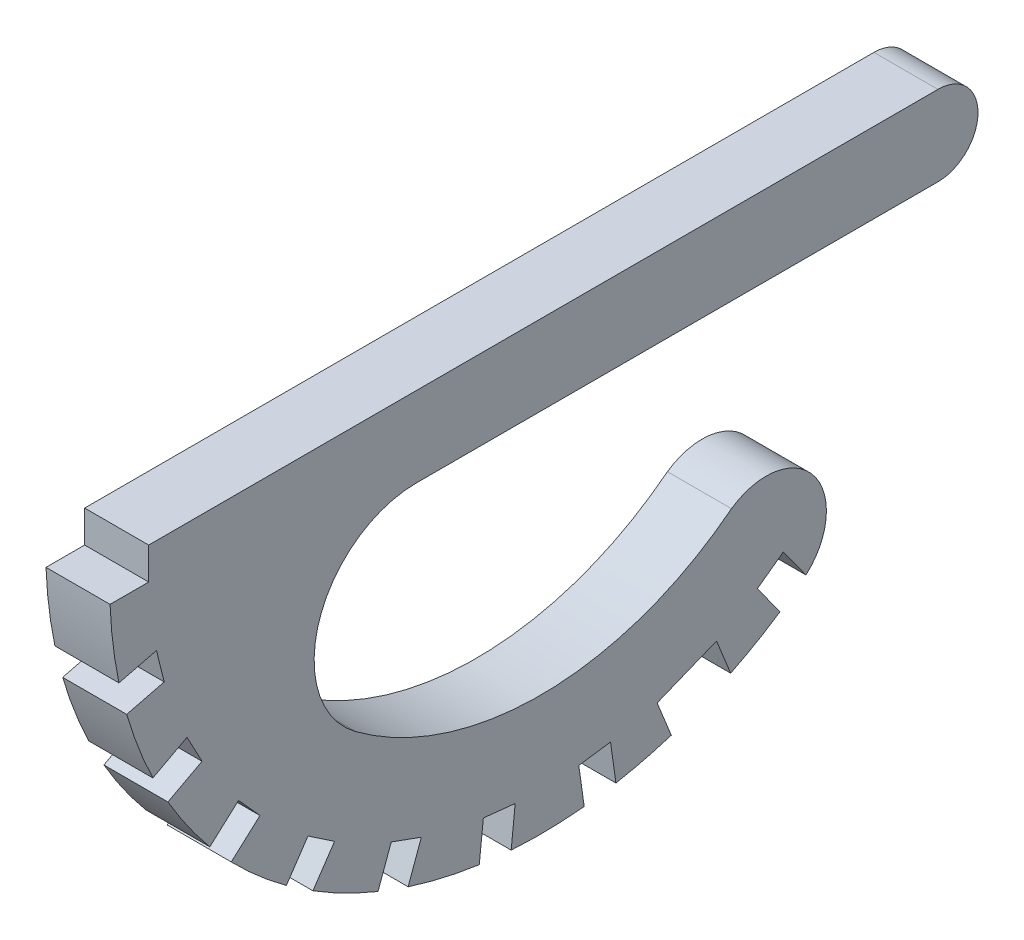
ISO-10303-21;
HEADER;
FILE_DESCRIPTION(('STEP AP214'),'2;1');
FILE_NAME('part.step','',(''),(''),'','','');
FILE_SCHEMA(('AUTOMOTIVE_DESIGN { 1 0 10303 214 1 1 1 1 }'));
ENDSEC;
DATA;
#1=APPLICATION_CONTEXT('core data for automotive mechanical design processes');
#2=APPLICATION_PROTOCOL_DEFINITION('international standard','automotive_design',2000,#1);
#3=PRODUCT_CONTEXT('',#1,'mechanical');
#4=PRODUCT('Part','Part','',(#3));
#5=PRODUCT_RELATED_PRODUCT_CATEGORY('part','',(#4));
#6=PRODUCT_DEFINITION_FORMATION('','',#4);
#7=PRODUCT_DEFINITION_CONTEXT('part definition',#1,'design');
#8=PRODUCT_DEFINITION('design','',#6,#7);
#9=PRODUCT_DEFINITION_SHAPE('','',#8);
#10=(LENGTH_UNIT() NAMED_UNIT(*) SI_UNIT(.MILLI.,.METRE.));
#11=(NAMED_UNIT(*) PLANE_ANGLE_UNIT() SI_UNIT($,.RADIAN.));
#12=(NAMED_UNIT(*) SI_UNIT($,.STERADIAN.) SOLID_ANGLE_UNIT());
#13=UNCERTAINTY_MEASURE_WITH_UNIT(LENGTH_MEASURE(1.E-05),#10,'distance_accuracy_value','');
#14=(GEOMETRIC_REPRESENTATION_CONTEXT(3) GLOBAL_UNCERTAINTY_ASSIGNED_CONTEXT((#13)) GLOBAL_UNIT_ASSIGNED_CONTEXT((#10,
#11,#12)) REPRESENTATION_CONTEXT('',''));
#15=CARTESIAN_POINT('',(0.,0.,0.));
#16=DIRECTION('',(0.,0.,1.));
#17=DIRECTION('',(1.,0.,0.));
#18=AXIS2_PLACEMENT_3D('',#15,#16,#17);
#19=CARTESIAN_POINT('',(336.,6.74291868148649,-16.6893093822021));
#20=DIRECTION('',(0.,0.374606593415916,-0.927183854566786));
#21=DIRECTION('',(0.,0.927183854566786,0.374606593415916));
#22=AXIS2_PLACEMENT_3D('',#19,#20,#21);
#23=PLANE('',#22);
#24=DIRECTION('',(0.,-0.927183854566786,-0.374606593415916));
#25=VECTOR('',#24,1.);
#26=CARTESIAN_POINT('',(300.,6.74291868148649,-16.6893093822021));
#27=LINE('',#26,#25);
#28=CARTESIAN_POINT('',(300.,-197.237529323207,-99.1027599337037));
#29=VERTEX_POINT('',#28);
#30=CARTESIAN_POINT('',(300.,-216.903251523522,-107.04822745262));
#31=VERTEX_POINT('',#30);
#32=EDGE_CURVE('E347',#29,#31,#27,.T.);
#33=ORIENTED_EDGE('',*,*,#32,.T.);
#34=DIRECTION('',(-1.,0.,0.));
#35=VECTOR('',#34,1.);
#36=CARTESIAN_POINT('',(336.,-216.903251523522,-107.04822745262));
#37=LINE('',#36,#35);
#38=CARTESIAN_POINT('',(336.,-216.903251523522,-107.04822745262));
#39=VERTEX_POINT('',#38);
#40=EDGE_CURVE('E11',#39,#31,#37,.T.);
#41=ORIENTED_EDGE('',*,*,#40,.F.);
#42=DIRECTION('',(0.,-0.927183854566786,-0.374606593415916));
#43=VECTOR('',#42,1.);
#44=CARTESIAN_POINT('',(336.,6.74291868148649,-16.6893093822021));
#45=LINE('',#44,#43);
#46=CARTESIAN_POINT('',(336.,-197.237529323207,-99.1027599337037));
#47=VERTEX_POINT('',#46);
#48=EDGE_CURVE('E465',#47,#39,#45,.T.);
#49=ORIENTED_EDGE('',*,*,#48,.F.);
#50=DIRECTION('',(-1.,0.,0.));
#51=VECTOR('',#50,1.);
#52=CARTESIAN_POINT('',(336.,-197.237529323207,-99.1027599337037));
#53=LINE('',#52,#51);
#54=EDGE_CURVE('E343',#47,#29,#53,.T.);
#55=ORIENTED_EDGE('',*,*,#54,.T.);
#56=EDGE_LOOP('',(#33,#41,#49,#55));
#57=FACE_BOUND('',#56,.T.);
#58=ADVANCED_FACE('F35',(#57),#23,.F.);
#59=CARTESIAN_POINT('',(336.,0.,0.));
#60=DIRECTION('',(-1.,0.,0.));
#61=DIRECTION('',(0.,0.,1.));
#62=AXIS2_PLACEMENT_3D('',#59,#60,#61);
#63=CYLINDRICAL_SURFACE('',#62,241.880845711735);
#64=CARTESIAN_POINT('',(300.,0.,0.));
#65=DIRECTION('',(1.,0.,0.));
#66=DIRECTION('',(0.,0.,-1.));
#67=AXIS2_PLACEMENT_3D('',#64,#65,#66);
#68=CIRCLE('',#67,241.880845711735);
#69=CARTESIAN_POINT('',(300.,-200.840275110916,-134.794389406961));
#70=VERTEX_POINT('',#69);
#71=EDGE_CURVE('E350',#31,#70,#68,.T.);
#72=ORIENTED_EDGE('',*,*,#71,.T.);
#73=DIRECTION('',(-1.,0.,0.));
#74=VECTOR('',#73,1.);
#75=CARTESIAN_POINT('',(336.,-200.840275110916,-134.794389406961));
#76=LINE('',#75,#74);
#77=CARTESIAN_POINT('',(336.,-200.840275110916,-134.794389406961));
#78=VERTEX_POINT('',#77);
#79=EDGE_CURVE('E43',#78,#70,#76,.T.);
#80=ORIENTED_EDGE('',*,*,#79,.F.);
#81=CARTESIAN_POINT('',(336.,0.,0.));
#82=DIRECTION('',(1.,0.,0.));
#83=DIRECTION('',(0.,0.,-1.));
#84=AXIS2_PLACEMENT_3D('',#81,#82,#83);
#85=CIRCLE('',#84,241.880845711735);
#86=EDGE_CURVE('E202',#39,#78,#85,.T.);
#87=ORIENTED_EDGE('',*,*,#86,.F.);
#88=ORIENTED_EDGE('',*,*,#40,.T.);
#89=EDGE_LOOP('',(#72,#80,#87,#88));
#90=FACE_BOUND('',#89,.T.);
#91=ADVANCED_FACE('F683',(#90),#63,.T.);
#92=CARTESIAN_POINT('',(336.,-5.29006727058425,7.28115294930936));
#93=DIRECTION('',(0.,-0.587785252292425,0.809016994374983));
#94=DIRECTION('',(0.,-0.809016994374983,-0.587785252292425));
#95=AXIS2_PLACEMENT_3D('',#92,#93,#94);
#96=PLANE('',#95);
#97=DIRECTION('',(0.,0.809016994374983,0.587785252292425));
#98=VECTOR('',#97,1.);
#99=CARTESIAN_POINT('',(300.,-5.29006727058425,7.28115294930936));
#100=LINE('',#99,#98);
#101=CARTESIAN_POINT('',(300.,-183.273806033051,-122.031602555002));
#102=VERTEX_POINT('',#101);
#103=EDGE_CURVE('E352',#70,#102,#100,.T.);
#104=ORIENTED_EDGE('',*,*,#103,.T.);
#105=DIRECTION('',(-1.,0.,0.));
#106=VECTOR('',#105,1.);
#107=CARTESIAN_POINT('',(336.,-183.273806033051,-122.031602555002));
#108=LINE('',#107,#106);
#109=CARTESIAN_POINT('',(336.,-183.273806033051,-122.031602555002));
#110=VERTEX_POINT('',#109);
#111=EDGE_CURVE('E550',#110,#102,#108,.T.);
#112=ORIENTED_EDGE('',*,*,#111,.F.);
#113=DIRECTION('',(0.,0.809016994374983,0.587785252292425));
#114=VECTOR('',#113,1.);
#115=CARTESIAN_POINT('',(336.,-5.29006727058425,7.28115294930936));
#116=LINE('',#115,#114);
#117=EDGE_CURVE('E557',#78,#110,#116,.T.);
#118=ORIENTED_EDGE('',*,*,#117,.F.);
#119=ORIENTED_EDGE('',*,*,#79,.T.);
#120=EDGE_LOOP('',(#104,#112,#118,#119));
#121=FACE_BOUND('',#120,.T.);
#122=ADVANCED_FACE('F555',(#121),#96,.F.);
#123=CARTESIAN_POINT('',(336.,-177.983738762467,-129.312755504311));
#124=DIRECTION('',(0.,-0.809016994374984,-0.587785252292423));
#125=DIRECTION('',(0.,0.587785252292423,-0.809016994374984));
#126=AXIS2_PLACEMENT_3D('',#123,#124,#125);
#127=PLANE('',#126);
#128=DIRECTION('',(0.,-0.587785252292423,0.809016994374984));
#129=VECTOR('',#128,1.);
#130=CARTESIAN_POINT('',(300.,-177.983738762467,-129.312755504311));
#131=LINE('',#130,#129);
#132=CARTESIAN_POINT('',(300.,-172.693671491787,-136.593908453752));
#133=VERTEX_POINT('',#132);
#134=EDGE_CURVE('E355',#133,#102,#131,.T.);
#135=ORIENTED_EDGE('',*,*,#134,.F.);
#136=DIRECTION('',(-1.,0.,0.));
#137=VECTOR('',#136,1.);
#138=CARTESIAN_POINT('',(336.,-172.693671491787,-136.593908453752));
#139=LINE('',#138,#137);
#140=CARTESIAN_POINT('',(336.,-172.693671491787,-136.593908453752));
#141=VERTEX_POINT('',#140);
#142=EDGE_CURVE('E548',#141,#133,#139,.T.);
#143=ORIENTED_EDGE('',*,*,#142,.F.);
#144=DIRECTION('',(0.,-0.587785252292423,0.809016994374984));
#145=VECTOR('',#144,1.);
#146=CARTESIAN_POINT('',(336.,-177.983738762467,-129.312755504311));
#147=LINE('',#146,#145);
#148=EDGE_CURVE('E567',#141,#110,#147,.T.);
#149=ORIENTED_EDGE('',*,*,#148,.T.);
#150=ORIENTED_EDGE('',*,*,#111,.T.);
#151=EDGE_LOOP('',(#135,#143,#149,#150));
#152=FACE_BOUND('',#151,.T.);
#153=ADVANCED_FACE('F564',(#152),#127,.T.);
#154=CARTESIAN_POINT('',(336.,5.29006727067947,-7.28115294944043));
#155=DIRECTION('',(0.,-0.587785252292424,0.809016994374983));
#156=DIRECTION('',(0.,-0.809016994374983,-0.587785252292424));
#157=AXIS2_PLACEMENT_3D('',#154,#155,#156);
#158=PLANE('',#157);
#159=DIRECTION('',(0.,0.809016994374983,0.587785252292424));
#160=VECTOR('',#159,1.);
#161=CARTESIAN_POINT('',(300.,5.29006727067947,-7.28115294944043));
#162=LINE('',#161,#160);
#163=CARTESIAN_POINT('',(300.,-190.255597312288,-149.35339443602));
#164=VERTEX_POINT('',#163);
#165=EDGE_CURVE('E358',#164,#133,#162,.T.);
#166=ORIENTED_EDGE('',*,*,#165,.F.);
#167=DIRECTION('',(-1.,0.,0.));
#168=VECTOR('',#167,1.);
#169=CARTESIAN_POINT('',(336.,-190.255597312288,-149.35339443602));
#170=LINE('',#169,#168);
#171=CARTESIAN_POINT('',(336.,-190.255597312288,-149.35339443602));
#172=VERTEX_POINT('',#171);
#173=EDGE_CURVE('E546',#172,#164,#170,.T.);
#174=ORIENTED_EDGE('',*,*,#173,.F.);
#175=DIRECTION('',(0.,0.809016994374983,0.587785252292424));
#176=VECTOR('',#175,1.);
#177=CARTESIAN_POINT('',(336.,5.29006727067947,-7.28115294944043));
#178=LINE('',#177,#176);
#179=EDGE_CURVE('E570',#172,#141,#178,.T.);
#180=ORIENTED_EDGE('',*,*,#179,.T.);
#181=ORIENTED_EDGE('',*,*,#142,.T.);
#182=EDGE_LOOP('',(#166,#174,#180,#181));
#183=FACE_BOUND('',#182,.T.);
#184=ADVANCED_FACE('F694',(#183),#158,.T.);
#185=CARTESIAN_POINT('',(336.,-164.822578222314,-126.938364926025));
#186=DIRECTION('',(-1.,0.,0.));
#187=DIRECTION('',(0.,0.,1.));
#188=AXIS2_PLACEMENT_3D('',#185,#186,#187);
#189=CYLINDRICAL_SURFACE('',#188,33.9009145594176);
#190=CARTESIAN_POINT('',(300.,-164.822578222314,-126.938364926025));
#191=DIRECTION('',(1.,0.,0.));
#192=DIRECTION('',(0.,0.,-1.));
#193=AXIS2_PLACEMENT_3D('',#190,#191,#192);
#194=CIRCLE('',#193,33.9009145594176);
#195=CARTESIAN_POINT('',(300.,-137.051522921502,-107.495101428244));
#196=VERTEX_POINT('',#195);
#197=EDGE_CURVE('E361',#196,#164,#194,.F.);
#198=ORIENTED_EDGE('',*,*,#197,.F.);
#199=DIRECTION('',(-1.,0.,0.));
#200=VECTOR('',#199,1.);
#201=CARTESIAN_POINT('',(336.,-137.051522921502,-107.495101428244));
#202=LINE('',#201,#200);
#203=CARTESIAN_POINT('',(336.,-137.051522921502,-107.495101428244));
#204=VERTEX_POINT('',#203);
#205=EDGE_CURVE('E544',#204,#196,#202,.T.);
#206=ORIENTED_EDGE('',*,*,#205,.F.);
#207=CARTESIAN_POINT('',(336.,-164.822578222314,-126.938364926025));
#208=DIRECTION('',(1.,0.,0.));
#209=DIRECTION('',(0.,0.,-1.));
#210=AXIS2_PLACEMENT_3D('',#207,#208,#209);
#211=CIRCLE('',#210,33.9009145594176);
#212=EDGE_CURVE('E572',#204,#172,#211,.F.);
#213=ORIENTED_EDGE('',*,*,#212,.T.);
#214=ORIENTED_EDGE('',*,*,#173,.T.);
#215=EDGE_LOOP('',(#198,#206,#213,#214));
#216=FACE_BOUND('',#215,.T.);
#217=ADVANCED_FACE('F697',(#216),#189,.T.);
#218=CARTESIAN_POINT('',(336.,0.,0.));
#219=DIRECTION('',(-1.,0.,0.));
#220=DIRECTION('',(0.,0.,1.));
#221=AXIS2_PLACEMENT_3D('',#218,#219,#220);
#222=CYLINDRICAL_SURFACE('',#221,174.178979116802);
#223=CARTESIAN_POINT('',(300.,0.,0.));
#224=DIRECTION('',(1.,0.,0.));
#225=DIRECTION('',(0.,0.,-1.));
#226=AXIS2_PLACEMENT_3D('',#223,#224,#225);
#227=CIRCLE('',#226,174.178979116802);
#228=CARTESIAN_POINT('',(300.,-139.91723643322,103.737571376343));
#229=VERTEX_POINT('',#228);
#230=EDGE_CURVE('E364',#229,#196,#227,.T.);
#231=ORIENTED_EDGE('',*,*,#230,.F.);
#232=DIRECTION('',(-1.,0.,0.));
#233=VECTOR('',#232,1.);
#234=CARTESIAN_POINT('',(336.,-139.91723643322,103.737571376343));
#235=LINE('',#234,#233);
#236=CARTESIAN_POINT('',(336.,-139.91723643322,103.737571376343));
#237=VERTEX_POINT('',#236);
#238=EDGE_CURVE('E542',#237,#229,#235,.T.);
#239=ORIENTED_EDGE('',*,*,#238,.F.);
#240=CARTESIAN_POINT('',(336.,0.,0.));
#241=DIRECTION('',(1.,0.,0.));
#242=DIRECTION('',(0.,0.,-1.));
#243=AXIS2_PLACEMENT_3D('',#240,#241,#242);
#244=CIRCLE('',#243,174.178979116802);
#245=EDGE_CURVE('E579',#237,#204,#244,.T.);
#246=ORIENTED_EDGE('',*,*,#245,.T.);
#247=ORIENTED_EDGE('',*,*,#205,.T.);
#248=EDGE_LOOP('',(#231,#239,#246,#247));
#249=FACE_BOUND('',#248,.T.);
#250=ADVANCED_FACE('F701',(#249),#222,.F.);
#251=CARTESIAN_POINT('',(336.,-93.6262853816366,69.4164901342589));
#252=DIRECTION('',(-1.,0.,0.));
#253=DIRECTION('',(0.,0.,1.));
#254=AXIS2_PLACEMENT_3D('',#251,#252,#253);
#255=CYLINDRICAL_SURFACE('',#254,57.6262853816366);
#256=CARTESIAN_POINT('',(300.,-93.6262853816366,69.4164901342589));
#257=DIRECTION('',(1.,0.,0.));
#258=DIRECTION('',(0.,0.,-1.));
#259=AXIS2_PLACEMENT_3D('',#256,#257,#258);
#260=CIRCLE('',#259,57.6262853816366);
#261=CARTESIAN_POINT('',(300.,-36.,69.4164901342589));
#262=VERTEX_POINT('',#261);
#263=EDGE_CURVE('E367',#262,#229,#260,.T.);
#264=ORIENTED_EDGE('',*,*,#263,.F.);
#265=DIRECTION('',(-1.,0.,0.));
#266=VECTOR('',#265,1.);
#267=CARTESIAN_POINT('',(336.,-36.,69.4164901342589));
#268=LINE('',#267,#266);
#269=CARTESIAN_POINT('',(336.,-36.,69.4164901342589));
#270=VERTEX_POINT('',#269);
#271=EDGE_CURVE('E540',#270,#262,#268,.T.);
#272=ORIENTED_EDGE('',*,*,#271,.F.);
#273=CARTESIAN_POINT('',(336.,-93.6262853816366,69.4164901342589));
#274=DIRECTION('',(1.,0.,0.));
#275=DIRECTION('',(0.,0.,-1.));
#276=AXIS2_PLACEMENT_3D('',#273,#274,#275);
#277=CIRCLE('',#276,57.6262853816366);
#278=EDGE_CURVE('E582',#270,#237,#277,.T.);
#279=ORIENTED_EDGE('',*,*,#278,.T.);
#280=ORIENTED_EDGE('',*,*,#238,.T.);
#281=EDGE_LOOP('',(#264,#272,#279,#280));
#282=FACE_BOUND('',#281,.T.);
#283=ADVANCED_FACE('F705',(#282),#255,.F.);
#284=CARTESIAN_POINT('',(336.,-36.,0.));
#285=DIRECTION('',(0.,-1.,0.));
#286=DIRECTION('',(0.,0.,-1.));
#287=AXIS2_PLACEMENT_3D('',#284,#285,#286);
#288=PLANE('',#287);
#289=DIRECTION('',(0.,0.,1.));
#290=VECTOR('',#289,1.);
#291=CARTESIAN_POINT('',(300.,-36.,0.));
#292=LINE('',#291,#290);
#293=CARTESIAN_POINT('',(300.,-36.,-223.530387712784));
#294=VERTEX_POINT('',#293);
#295=EDGE_CURVE('E370',#294,#262,#292,.T.);
#296=ORIENTED_EDGE('',*,*,#295,.F.);
#297=DIRECTION('',(-1.,0.,0.));
#298=VECTOR('',#297,1.);
#299=CARTESIAN_POINT('',(336.,-36.,-223.530387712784));
#300=LINE('',#299,#298);
#301=CARTESIAN_POINT('',(336.,-36.,-223.530387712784));
#302=VERTEX_POINT('',#301);
#303=EDGE_CURVE('E538',#302,#294,#300,.T.);
#304=ORIENTED_EDGE('',*,*,#303,.F.);
#305=DIRECTION('',(0.,0.,1.));
#306=VECTOR('',#305,1.);
#307=CARTESIAN_POINT('',(336.,-36.,0.));
#308=LINE('',#307,#306);
#309=EDGE_CURVE('E585',#302,#270,#308,.T.);
#310=ORIENTED_EDGE('',*,*,#309,.T.);
#311=ORIENTED_EDGE('',*,*,#271,.T.);
#312=EDGE_LOOP('',(#296,#304,#310,#311));
#313=FACE_BOUND('',#312,.T.);
#314=ADVANCED_FACE('F709',(#313),#288,.T.);
#315=CARTESIAN_POINT('',(336.,-13.5,-223.530387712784));
#316=DIRECTION('',(-1.,0.,0.));
#317=DIRECTION('',(0.,0.,1.));
#318=AXIS2_PLACEMENT_3D('',#315,#316,#317);
#319=CYLINDRICAL_SURFACE('',#318,22.5);
#320=CARTESIAN_POINT('',(300.,-13.5,-223.530387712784));
#321=DIRECTION('',(1.,0.,0.));
#322=DIRECTION('',(0.,0.,-1.));
#323=AXIS2_PLACEMENT_3D('',#320,#321,#322);
#324=CIRCLE('',#323,22.5);
#325=CARTESIAN_POINT('',(300.,9.,-223.530387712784));
#326=VERTEX_POINT('',#325);
#327=EDGE_CURVE('E373',#294,#326,#324,.T.);
#328=ORIENTED_EDGE('',*,*,#327,.T.);
#329=DIRECTION('',(-1.,0.,0.));
#330=VECTOR('',#329,1.);
#331=CARTESIAN_POINT('',(336.,9.,-223.530387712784));
#332=LINE('',#331,#330);
#333=CARTESIAN_POINT('',(336.,9.,-223.530387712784));
#334=VERTEX_POINT('',#333);
#335=EDGE_CURVE('E536',#334,#326,#332,.T.);
#336=ORIENTED_EDGE('',*,*,#335,.F.);
#337=CARTESIAN_POINT('',(336.,-13.5,-223.530387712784));
#338=DIRECTION('',(1.,0.,0.));
#339=DIRECTION('',(0.,0.,-1.));
#340=AXIS2_PLACEMENT_3D('',#337,#338,#339);
#341=CIRCLE('',#340,22.5);
#342=EDGE_CURVE('E588',#302,#334,#341,.T.);
#343=ORIENTED_EDGE('',*,*,#342,.F.);
#344=ORIENTED_EDGE('',*,*,#303,.T.);
#345=EDGE_LOOP('',(#328,#336,#343,#344));
#346=FACE_BOUND('',#345,.T.);
#347=ADVANCED_FACE('F713',(#346),#319,.T.);
#348=CARTESIAN_POINT('',(336.,9.,0.));
#349=DIRECTION('',(0.,1.,0.));
#350=DIRECTION('',(0.,0.,1.));
#351=AXIS2_PLACEMENT_3D('',#348,#349,#350);
#352=PLANE('',#351);
#353=DIRECTION('',(0.,0.,-1.));
#354=VECTOR('',#353,1.);
#355=CARTESIAN_POINT('',(300.,9.,0.));
#356=LINE('',#355,#354);
#357=CARTESIAN_POINT('',(300.,9.,220.));
#358=VERTEX_POINT('',#357);
#359=EDGE_CURVE('E376',#358,#326,#356,.T.);
#360=ORIENTED_EDGE('',*,*,#359,.F.);
#361=DIRECTION('',(-1.,0.,0.));
#362=VECTOR('',#361,1.);
#363=CARTESIAN_POINT('',(336.,9.,220.));
#364=LINE('',#363,#362);
#365=CARTESIAN_POINT('',(336.,9.,220.));
#366=VERTEX_POINT('',#365);
#367=EDGE_CURVE('E534',#366,#358,#364,.T.);
#368=ORIENTED_EDGE('',*,*,#367,.F.);
#369=DIRECTION('',(0.,0.,-1.));
#370=VECTOR('',#369,1.);
#371=CARTESIAN_POINT('',(336.,9.,0.));
#372=LINE('',#371,#370);
#373=EDGE_CURVE('E590',#366,#334,#372,.T.);
#374=ORIENTED_EDGE('',*,*,#373,.T.);
#375=ORIENTED_EDGE('',*,*,#335,.T.);
#376=EDGE_LOOP('',(#360,#368,#374,#375));
#377=FACE_BOUND('',#376,.T.);
#378=ADVANCED_FACE('F717',(#377),#352,.T.);
#379=CARTESIAN_POINT('',(336.,0.,220.));
#380=DIRECTION('',(0.,0.,1.));
#381=DIRECTION('',(1.,0.,0.));
#382=AXIS2_PLACEMENT_3D('',#379,#380,#381);
#383=PLANE('',#382);
#384=DIRECTION('',(0.,1.,0.));
#385=VECTOR('',#384,1.);
#386=CARTESIAN_POINT('',(300.,0.,220.));
#387=LINE('',#386,#385);
#388=CARTESIAN_POINT('',(300.,-9.,220.));
#389=VERTEX_POINT('',#388);
#390=EDGE_CURVE('E379',#389,#358,#387,.T.);
#391=ORIENTED_EDGE('',*,*,#390,.F.);
#392=DIRECTION('',(-1.,0.,0.));
#393=VECTOR('',#392,1.);
#394=CARTESIAN_POINT('',(336.,-9.,220.));
#395=LINE('',#394,#393);
#396=CARTESIAN_POINT('',(336.,-9.,220.));
#397=VERTEX_POINT('',#396);
#398=EDGE_CURVE('E532',#397,#389,#395,.T.);
#399=ORIENTED_EDGE('',*,*,#398,.F.);
#400=DIRECTION('',(0.,1.,0.));
#401=VECTOR('',#400,1.);
#402=CARTESIAN_POINT('',(336.,0.,220.));
#403=LINE('',#402,#401);
#404=EDGE_CURVE('E593',#397,#366,#403,.T.);
#405=ORIENTED_EDGE('',*,*,#404,.T.);
#406=ORIENTED_EDGE('',*,*,#367,.T.);
#407=EDGE_LOOP('',(#391,#399,#405,#406));
#408=FACE_BOUND('',#407,.T.);
#409=ADVANCED_FACE('F721',(#408),#383,.T.);
#410=CARTESIAN_POINT('',(336.,-9.,0.));
#411=DIRECTION('',(0.,1.,0.));
#412=DIRECTION('',(0.,0.,1.));
#413=AXIS2_PLACEMENT_3D('',#410,#411,#412);
#414=PLANE('',#413);
#415=DIRECTION('',(0.,0.,-1.));
#416=VECTOR('',#415,1.);
#417=CARTESIAN_POINT('',(300.,-9.,0.));
#418=LINE('',#417,#416);
#419=CARTESIAN_POINT('',(300.,-9.,241.713349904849));
#420=VERTEX_POINT('',#419);
#421=EDGE_CURVE('E382',#420,#389,#418,.T.);
#422=ORIENTED_EDGE('',*,*,#421,.F.);
#423=DIRECTION('',(-1.,0.,0.));
#424=VECTOR('',#423,1.);
#425=CARTESIAN_POINT('',(336.,-9.,241.713349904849));
#426=LINE('',#425,#424);
#427=CARTESIAN_POINT('',(336.,-9.,241.713349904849));
#428=VERTEX_POINT('',#427);
#429=EDGE_CURVE('E530',#428,#420,#426,.T.);
#430=ORIENTED_EDGE('',*,*,#429,.F.);
#431=DIRECTION('',(0.,0.,-1.));
#432=VECTOR('',#431,1.);
#433=CARTESIAN_POINT('',(336.,-9.,0.));
#434=LINE('',#433,#432);
#435=EDGE_CURVE('E596',#428,#397,#434,.T.);
#436=ORIENTED_EDGE('',*,*,#435,.T.);
#437=ORIENTED_EDGE('',*,*,#398,.T.);
#438=EDGE_LOOP('',(#422,#430,#436,#437));
#439=FACE_BOUND('',#438,.T.);
#440=ADVANCED_FACE('F725',(#439),#414,.T.);
#441=CARTESIAN_POINT('',(336.,0.,0.));
#442=DIRECTION('',(-1.,0.,0.));
#443=DIRECTION('',(0.,0.,1.));
#444=AXIS2_PLACEMENT_3D('',#441,#442,#443);
#445=CYLINDRICAL_SURFACE('',#444,241.880845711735);
#446=CARTESIAN_POINT('',(300.,0.,0.));
#447=DIRECTION('',(1.,0.,0.));
#448=DIRECTION('',(0.,0.,-1.));
#449=AXIS2_PLACEMENT_3D('',#446,#447,#448);
#450=CIRCLE('',#449,241.880845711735);
#451=CARTESIAN_POINT('',(300.,-49.7430902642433,236.710727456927));
#452=VERTEX_POINT('',#451);
#453=EDGE_CURVE('E385',#420,#452,#450,.T.);
#454=ORIENTED_EDGE('',*,*,#453,.T.);
#455=DIRECTION('',(-1.,0.,0.));
#456=VECTOR('',#455,1.);
#457=CARTESIAN_POINT('',(336.,-49.7430902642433,236.710727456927));
#458=LINE('',#457,#456);
#459=CARTESIAN_POINT('',(336.,-49.7430902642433,236.710727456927));
#460=VERTEX_POINT('',#459);
#461=EDGE_CURVE('E527',#460,#452,#458,.T.);
#462=ORIENTED_EDGE('',*,*,#461,.F.);
#463=CARTESIAN_POINT('',(336.,0.,0.));
#464=DIRECTION('',(1.,0.,0.));
#465=DIRECTION('',(0.,0.,-1.));
#466=AXIS2_PLACEMENT_3D('',#463,#464,#465);
#467=CIRCLE('',#466,241.880845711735);
#468=EDGE_CURVE('E599',#428,#460,#467,.T.);
#469=ORIENTED_EDGE('',*,*,#468,.F.);
#470=ORIENTED_EDGE('',*,*,#429,.T.);
#471=EDGE_LOOP('',(#454,#462,#469,#470));
#472=FACE_BOUND('',#471,.T.);
#473=ADVANCED_FACE('F729',(#472),#445,.T.);
#474=CARTESIAN_POINT('',(336.,8.73266153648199,2.17729706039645));
#475=DIRECTION('',(0.,0.970295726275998,0.241921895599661));
#476=DIRECTION('',(0.,-0.241921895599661,0.970295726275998));
#477=AXIS2_PLACEMENT_3D('',#474,#475,#476);
#478=PLANE('',#477);
#479=DIRECTION('',(0.,0.241921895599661,-0.970295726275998));
#480=VECTOR('',#479,1.);
#481=CARTESIAN_POINT('',(300.,8.73266153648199,2.17729706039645));
#482=LINE('',#481,#480);
#483=CARTESIAN_POINT('',(300.,-44.4901554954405,215.642356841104));
#484=VERTEX_POINT('',#483);
#485=EDGE_CURVE('E387',#452,#484,#482,.T.);
#486=ORIENTED_EDGE('',*,*,#485,.T.);
#487=DIRECTION('',(-1.,0.,0.));
#488=VECTOR('',#487,1.);
#489=CARTESIAN_POINT('',(336.,-44.4901554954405,215.642356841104));
#490=LINE('',#489,#488);
#491=CARTESIAN_POINT('',(336.,-44.4901554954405,215.642356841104));
#492=VERTEX_POINT('',#491);
#493=EDGE_CURVE('E525',#492,#484,#490,.T.);
#494=ORIENTED_EDGE('',*,*,#493,.F.);
#495=DIRECTION('',(0.,0.241921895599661,-0.970295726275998));
#496=VECTOR('',#495,1.);
#497=CARTESIAN_POINT('',(336.,8.73266153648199,2.17729706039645));
#498=LINE('',#497,#496);
#499=EDGE_CURVE('E601',#460,#492,#498,.T.);
#500=ORIENTED_EDGE('',*,*,#499,.F.);
#501=ORIENTED_EDGE('',*,*,#461,.T.);
#502=EDGE_LOOP('',(#486,#494,#500,#501));
#503=FACE_BOUND('',#502,.T.);
#504=ADVANCED_FACE('F733',(#503),#478,.F.);
#505=CARTESIAN_POINT('',(336.,-53.2228170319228,213.465059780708));
#506=DIRECTION('',(0.,-0.241921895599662,0.970295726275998));
#507=DIRECTION('',(0.,-0.970295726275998,-0.241921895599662));
#508=AXIS2_PLACEMENT_3D('',#505,#506,#507);
#509=PLANE('',#508);
#510=DIRECTION('',(0.,0.970295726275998,0.241921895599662));
#511=VECTOR('',#510,1.);
#512=CARTESIAN_POINT('',(300.,-53.2228170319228,213.465059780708));
#513=LINE('',#512,#511);
#514=CARTESIAN_POINT('',(300.,-61.9554785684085,211.287762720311));
#515=VERTEX_POINT('',#514);
#516=EDGE_CURVE('E390',#515,#484,#513,.T.);
#517=ORIENTED_EDGE('',*,*,#516,.F.);
#518=DIRECTION('',(-1.,0.,0.));
#519=VECTOR('',#518,1.);
#520=CARTESIAN_POINT('',(336.,-61.9554785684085,211.287762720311));
#521=LINE('',#520,#519);
#522=CARTESIAN_POINT('',(336.,-61.9554785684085,211.287762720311));
#523=VERTEX_POINT('',#522);
#524=EDGE_CURVE('E523',#523,#515,#521,.T.);
#525=ORIENTED_EDGE('',*,*,#524,.F.);
#526=DIRECTION('',(0.,0.970295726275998,0.241921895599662));
#527=VECTOR('',#526,1.);
#528=CARTESIAN_POINT('',(336.,-53.2228170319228,213.465059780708));
#529=LINE('',#528,#527);
#530=EDGE_CURVE('E603',#523,#492,#529,.T.);
#531=ORIENTED_EDGE('',*,*,#530,.T.);
#532=ORIENTED_EDGE('',*,*,#493,.T.);
#533=EDGE_LOOP('',(#517,#525,#531,#532));
#534=FACE_BOUND('',#533,.T.);
#535=ADVANCED_FACE('F737',(#534),#509,.T.);
#536=CARTESIAN_POINT('',(336.,-8.73266153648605,-2.17729706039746));
#537=DIRECTION('',(0.,0.970295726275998,0.241921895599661));
#538=DIRECTION('',(0.,-0.241921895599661,0.970295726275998));
#539=AXIS2_PLACEMENT_3D('',#536,#537,#538);
#540=PLANE('',#539);
#541=DIRECTION('',(0.,0.241921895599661,-0.970295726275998));
#542=VECTOR('',#541,1.);
#543=CARTESIAN_POINT('',(300.,-8.73266153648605,-2.17729706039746));
#544=LINE('',#543,#542);
#545=CARTESIAN_POINT('',(300.,-67.2084133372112,232.356133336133));
#546=VERTEX_POINT('',#545);
#547=EDGE_CURVE('E393',#546,#515,#544,.T.);
#548=ORIENTED_EDGE('',*,*,#547,.F.);
#549=DIRECTION('',(-1.,0.,0.));
#550=VECTOR('',#549,1.);
#551=CARTESIAN_POINT('',(336.,-67.2084133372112,232.356133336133));
#552=LINE('',#551,#550);
#553=CARTESIAN_POINT('',(336.,-67.2084133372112,232.356133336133));
#554=VERTEX_POINT('',#553);
#555=EDGE_CURVE('E521',#554,#546,#552,.T.);
#556=ORIENTED_EDGE('',*,*,#555,.F.);
#557=DIRECTION('',(0.,0.241921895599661,-0.970295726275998));
#558=VECTOR('',#557,1.);
#559=CARTESIAN_POINT('',(336.,-8.73266153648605,-2.17729706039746));
#560=LINE('',#559,#558);
#561=EDGE_CURVE('E606',#554,#523,#560,.T.);
#562=ORIENTED_EDGE('',*,*,#561,.T.);
#563=ORIENTED_EDGE('',*,*,#524,.T.);
#564=EDGE_LOOP('',(#548,#556,#562,#563));
#565=FACE_BOUND('',#564,.T.);
#566=ADVANCED_FACE('F741',(#565),#540,.T.);
#567=CARTESIAN_POINT('',(336.,0.,0.));
#568=DIRECTION('',(-1.,0.,0.));
#569=DIRECTION('',(0.,0.,1.));
#570=AXIS2_PLACEMENT_3D('',#567,#568,#569);
#571=CYLINDRICAL_SURFACE('',#570,241.880845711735);
#572=CARTESIAN_POINT('',(300.,0.,0.));
#573=DIRECTION('',(1.,0.,0.));
#574=DIRECTION('',(0.,0.,-1.));
#575=AXIS2_PLACEMENT_3D('',#572,#573,#574);
#576=CIRCLE('',#575,241.880845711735);
#577=CARTESIAN_POINT('',(300.,-105.531015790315,217.645464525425));
#578=VERTEX_POINT('',#577);
#579=EDGE_CURVE('E396',#546,#578,#576,.T.);
#580=ORIENTED_EDGE('',*,*,#579,.T.);
#581=DIRECTION('',(-1.,0.,0.));
#582=VECTOR('',#581,1.);
#583=CARTESIAN_POINT('',(336.,-105.531015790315,217.645464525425));
#584=LINE('',#583,#582);
#585=CARTESIAN_POINT('',(336.,-105.531015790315,217.645464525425));
#586=VERTEX_POINT('',#585);
#587=EDGE_CURVE('E518',#586,#578,#584,.T.);
#588=ORIENTED_EDGE('',*,*,#587,.F.);
#589=CARTESIAN_POINT('',(336.,0.,0.));
#590=DIRECTION('',(1.,0.,0.));
#591=DIRECTION('',(0.,0.,-1.));
#592=AXIS2_PLACEMENT_3D('',#589,#590,#591);
#593=CIRCLE('',#592,241.880845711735);
#594=EDGE_CURVE('E609',#554,#586,#593,.T.);
#595=ORIENTED_EDGE('',*,*,#594,.F.);
#596=ORIENTED_EDGE('',*,*,#555,.T.);
#597=EDGE_LOOP('',(#580,#588,#595,#596));
#598=FACE_BOUND('',#597,.T.);
#599=ADVANCED_FACE('F745',(#598),#571,.T.);
#600=CARTESIAN_POINT('',(336.,7.94652833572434,4.22524406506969));
#601=DIRECTION('',(0.,0.882947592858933,0.469471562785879));
#602=DIRECTION('',(0.,-0.469471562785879,0.882947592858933));
#603=AXIS2_PLACEMENT_3D('',#600,#601,#602);
#604=PLANE('',#603);
#605=DIRECTION('',(0.,0.469471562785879,-0.882947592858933));
#606=VECTOR('',#605,1.);
#607=CARTESIAN_POINT('',(300.,7.94652833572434,4.22524406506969));
#608=LINE('',#607,#606);
#609=CARTESIAN_POINT('',(300.,-95.3372154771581,198.473714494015));
#610=VERTEX_POINT('',#609);
#611=EDGE_CURVE('E398',#578,#610,#608,.T.);
#612=ORIENTED_EDGE('',*,*,#611,.T.);
#613=DIRECTION('',(-1.,0.,0.));
#614=VECTOR('',#613,1.);
#615=CARTESIAN_POINT('',(336.,-95.3372154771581,198.473714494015));
#616=LINE('',#615,#614);
#617=CARTESIAN_POINT('',(336.,-95.3372154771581,198.473714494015));
#618=VERTEX_POINT('',#617);
#619=EDGE_CURVE('E516',#618,#610,#616,.T.);
#620=ORIENTED_EDGE('',*,*,#619,.F.);
#621=DIRECTION('',(0.,0.469471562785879,-0.882947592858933));
#622=VECTOR('',#621,1.);
#623=CARTESIAN_POINT('',(336.,7.94652833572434,4.22524406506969));
#624=LINE('',#623,#622);
#625=EDGE_CURVE('E611',#586,#618,#624,.T.);
#626=ORIENTED_EDGE('',*,*,#625,.F.);
#627=ORIENTED_EDGE('',*,*,#587,.T.);
#628=EDGE_LOOP('',(#612,#620,#626,#627));
#629=FACE_BOUND('',#628,.T.);
#630=ADVANCED_FACE('F749',(#629),#604,.F.);
#631=CARTESIAN_POINT('',(336.,-103.283743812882,194.248470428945));
#632=DIRECTION('',(0.,-0.469471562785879,0.882947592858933));
#633=DIRECTION('',(0.,-0.882947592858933,-0.469471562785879));
#634=AXIS2_PLACEMENT_3D('',#631,#632,#633);
#635=PLANE('',#634);
#636=DIRECTION('',(0.,0.882947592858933,0.469471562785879));
#637=VECTOR('',#636,1.);
#638=CARTESIAN_POINT('',(300.,-103.283743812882,194.248470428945));
#639=LINE('',#638,#637);
#640=CARTESIAN_POINT('',(300.,-111.230272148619,190.023226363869));
#641=VERTEX_POINT('',#640);
#642=EDGE_CURVE('E401',#641,#610,#639,.T.);
#643=ORIENTED_EDGE('',*,*,#642,.F.);
#644=DIRECTION('',(-1.,0.,0.));
#645=VECTOR('',#644,1.);
#646=CARTESIAN_POINT('',(336.,-111.230272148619,190.023226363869));
#647=LINE('',#646,#645);
#648=CARTESIAN_POINT('',(336.,-111.230272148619,190.023226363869));
#649=VERTEX_POINT('',#648);
#650=EDGE_CURVE('E514',#649,#641,#647,.T.);
#651=ORIENTED_EDGE('',*,*,#650,.F.);
#652=DIRECTION('',(0.,0.882947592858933,0.469471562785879));
#653=VECTOR('',#652,1.);
#654=CARTESIAN_POINT('',(336.,-103.283743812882,194.248470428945));
#655=LINE('',#654,#653);
#656=EDGE_CURVE('E613',#649,#618,#655,.T.);
#657=ORIENTED_EDGE('',*,*,#656,.T.);
#658=ORIENTED_EDGE('',*,*,#619,.T.);
#659=EDGE_LOOP('',(#643,#651,#657,#658));
#660=FACE_BOUND('',#659,.T.);
#661=ADVANCED_FACE('F753',(#660),#635,.T.);
#662=CARTESIAN_POINT('',(336.,-7.94652833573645,-4.22524406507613));
#663=DIRECTION('',(0.,0.882947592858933,0.469471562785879));
#664=DIRECTION('',(0.,-0.469471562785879,0.882947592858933));
#665=AXIS2_PLACEMENT_3D('',#662,#663,#664);
#666=PLANE('',#665);
#667=DIRECTION('',(0.,0.469471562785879,-0.882947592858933));
#668=VECTOR('',#667,1.);
#669=CARTESIAN_POINT('',(300.,-7.94652833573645,-4.22524406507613));
#670=LINE('',#669,#668);
#671=CARTESIAN_POINT('',(300.,-121.424072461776,209.194976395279));
#672=VERTEX_POINT('',#671);
#673=EDGE_CURVE('E404',#672,#641,#670,.T.);
#674=ORIENTED_EDGE('',*,*,#673,.F.);
#675=DIRECTION('',(-1.,0.,0.));
#676=VECTOR('',#675,1.);
#677=CARTESIAN_POINT('',(336.,-121.424072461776,209.194976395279));
#678=LINE('',#677,#676);
#679=CARTESIAN_POINT('',(336.,-121.424072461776,209.194976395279));
#680=VERTEX_POINT('',#679);
#681=EDGE_CURVE('E512',#680,#672,#678,.T.);
#682=ORIENTED_EDGE('',*,*,#681,.F.);
#683=DIRECTION('',(0.,0.469471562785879,-0.882947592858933));
#684=VECTOR('',#683,1.);
#685=CARTESIAN_POINT('',(336.,-7.94652833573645,-4.22524406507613));
#686=LINE('',#685,#684);
#687=EDGE_CURVE('E616',#680,#649,#686,.T.);
#688=ORIENTED_EDGE('',*,*,#687,.T.);
#689=ORIENTED_EDGE('',*,*,#650,.T.);
#690=EDGE_LOOP('',(#674,#682,#688,#689));
#691=FACE_BOUND('',#690,.T.);
#692=ADVANCED_FACE('F757',(#691),#666,.T.);
#693=CARTESIAN_POINT('',(336.,0.,0.));
#694=DIRECTION('',(-1.,0.,0.));
#695=DIRECTION('',(0.,0.,1.));
#696=AXIS2_PLACEMENT_3D('',#693,#694,#695);
#697=CYLINDRICAL_SURFACE('',#696,241.880845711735);
#698=CARTESIAN_POINT('',(300.,0.,0.));
#699=DIRECTION('',(1.,0.,0.));
#700=DIRECTION('',(0.,0.,-1.));
#701=AXIS2_PLACEMENT_3D('',#698,#699,#700);
#702=CIRCLE('',#701,241.880845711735);
#703=CARTESIAN_POINT('',(300.,-155.049496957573,185.650200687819));
#704=VERTEX_POINT('',#703);
#705=EDGE_CURVE('E407',#672,#704,#702,.T.);
#706=ORIENTED_EDGE('',*,*,#705,.T.);
#707=DIRECTION('',(-1.,0.,0.));
#708=VECTOR('',#707,1.);
#709=CARTESIAN_POINT('',(336.,-155.049496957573,185.650200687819));
#710=LINE('',#709,#708);
#711=CARTESIAN_POINT('',(336.,-155.049496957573,185.650200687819));
#712=VERTEX_POINT('',#711);
#713=EDGE_CURVE('E509',#712,#704,#710,.T.);
#714=ORIENTED_EDGE('',*,*,#713,.F.);
#715=CARTESIAN_POINT('',(336.,0.,0.));
#716=DIRECTION('',(1.,0.,0.));
#717=DIRECTION('',(0.,0.,-1.));
#718=AXIS2_PLACEMENT_3D('',#715,#716,#717);
#719=CIRCLE('',#718,241.880845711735);
#720=EDGE_CURVE('E619',#680,#712,#719,.T.);
#721=ORIENTED_EDGE('',*,*,#720,.F.);
#722=ORIENTED_EDGE('',*,*,#681,.T.);
#723=EDGE_LOOP('',(#706,#714,#721,#722));
#724=FACE_BOUND('',#723,.T.);
#725=ADVANCED_FACE('F761',(#724),#697,.T.);
#726=CARTESIAN_POINT('',(336.,6.68830342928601,6.02217545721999));
#727=DIRECTION('',(0.,0.743144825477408,0.669130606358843));
#728=DIRECTION('',(0.,-0.669130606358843,0.743144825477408));
#729=AXIS2_PLACEMENT_3D('',#726,#727,#728);
#730=PLANE('',#729);
#731=DIRECTION('',(0.,0.669130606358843,-0.743144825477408));
#732=VECTOR('',#731,1.);
#733=CARTESIAN_POINT('',(300.,6.68830342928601,6.02217545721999));
#734=LINE('',#733,#732);
#735=CARTESIAN_POINT('',(300.,-140.520429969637,169.514037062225));
#736=VERTEX_POINT('',#735);
#737=EDGE_CURVE('E409',#704,#736,#734,.T.);
#738=ORIENTED_EDGE('',*,*,#737,.T.);
#739=DIRECTION('',(-1.,0.,0.));
#740=VECTOR('',#739,1.);
#741=CARTESIAN_POINT('',(336.,-140.520429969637,169.514037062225));
#742=LINE('',#741,#740);
#743=CARTESIAN_POINT('',(336.,-140.520429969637,169.514037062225));
#744=VERTEX_POINT('',#743);
#745=EDGE_CURVE('E507',#744,#736,#742,.T.);
#746=ORIENTED_EDGE('',*,*,#745,.F.);
#747=DIRECTION('',(0.,0.669130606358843,-0.743144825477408));
#748=VECTOR('',#747,1.);
#749=CARTESIAN_POINT('',(336.,6.68830342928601,6.02217545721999));
#750=LINE('',#749,#748);
#751=EDGE_CURVE('E621',#712,#744,#750,.T.);
#752=ORIENTED_EDGE('',*,*,#751,.F.);
#753=ORIENTED_EDGE('',*,*,#713,.T.);
#754=EDGE_LOOP('',(#738,#746,#752,#753));
#755=FACE_BOUND('',#754,.T.);
#756=ADVANCED_FACE('F765',(#755),#730,.F.);
#757=CARTESIAN_POINT('',(336.,-147.208733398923,163.491861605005));
#758=DIRECTION('',(0.,-0.669130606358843,0.743144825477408));
#759=DIRECTION('',(0.,-0.743144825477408,-0.669130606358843));
#760=AXIS2_PLACEMENT_3D('',#757,#758,#759);
#761=PLANE('',#760);
#762=DIRECTION('',(0.,0.743144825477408,0.669130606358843));
#763=VECTOR('',#762,1.);
#764=CARTESIAN_POINT('',(300.,-147.208733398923,163.491861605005));
#765=LINE('',#764,#763);
#766=CARTESIAN_POINT('',(300.,-153.897036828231,157.469686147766));
#767=VERTEX_POINT('',#766);
#768=EDGE_CURVE('E412',#767,#736,#765,.T.);
#769=ORIENTED_EDGE('',*,*,#768,.F.);
#770=DIRECTION('',(-1.,0.,0.));
#771=VECTOR('',#770,1.);
#772=CARTESIAN_POINT('',(336.,-153.897036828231,157.469686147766));
#773=LINE('',#772,#771);
#774=CARTESIAN_POINT('',(336.,-153.897036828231,157.469686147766));
#775=VERTEX_POINT('',#774);
#776=EDGE_CURVE('E505',#775,#767,#773,.T.);
#777=ORIENTED_EDGE('',*,*,#776,.F.);
#778=DIRECTION('',(0.,0.743144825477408,0.669130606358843));
#779=VECTOR('',#778,1.);
#780=CARTESIAN_POINT('',(336.,-147.208733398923,163.491861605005));
#781=LINE('',#780,#779);
#782=EDGE_CURVE('E623',#775,#744,#781,.T.);
#783=ORIENTED_EDGE('',*,*,#782,.T.);
#784=ORIENTED_EDGE('',*,*,#745,.T.);
#785=EDGE_LOOP('',(#769,#777,#783,#784));
#786=FACE_BOUND('',#785,.T.);
#787=ADVANCED_FACE('F769',(#786),#761,.T.);
#788=CARTESIAN_POINT('',(336.,-6.68830342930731,-6.02217545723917));
#789=DIRECTION('',(0.,0.743144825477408,0.669130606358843));
#790=DIRECTION('',(0.,-0.669130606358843,0.743144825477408));
#791=AXIS2_PLACEMENT_3D('',#788,#789,#790);
#792=PLANE('',#791);
#793=DIRECTION('',(0.,0.669130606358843,-0.743144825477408));
#794=VECTOR('',#793,1.);
#795=CARTESIAN_POINT('',(300.,-6.68830342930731,-6.02217545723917));
#796=LINE('',#795,#794);
#797=CARTESIAN_POINT('',(300.,-168.426103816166,173.605849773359));
#798=VERTEX_POINT('',#797);
#799=EDGE_CURVE('E415',#798,#767,#796,.T.);
#800=ORIENTED_EDGE('',*,*,#799,.F.);
#801=DIRECTION('',(-1.,0.,0.));
#802=VECTOR('',#801,1.);
#803=CARTESIAN_POINT('',(336.,-168.426103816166,173.605849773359));
#804=LINE('',#803,#802);
#805=CARTESIAN_POINT('',(336.,-168.426103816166,173.605849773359));
#806=VERTEX_POINT('',#805);
#807=EDGE_CURVE('E503',#806,#798,#804,.T.);
#808=ORIENTED_EDGE('',*,*,#807,.F.);
#809=DIRECTION('',(0.,0.669130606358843,-0.743144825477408));
#810=VECTOR('',#809,1.);
#811=CARTESIAN_POINT('',(336.,-6.68830342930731,-6.02217545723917));
#812=LINE('',#811,#810);
#813=EDGE_CURVE('E626',#806,#775,#812,.T.);
#814=ORIENTED_EDGE('',*,*,#813,.T.);
#815=ORIENTED_EDGE('',*,*,#776,.T.);
#816=EDGE_LOOP('',(#800,#808,#814,#815));
#817=FACE_BOUND('',#816,.T.);
#818=ADVANCED_FACE('F773',(#817),#792,.T.);
#819=CARTESIAN_POINT('',(336.,0.,0.));
#820=DIRECTION('',(-1.,0.,0.));
#821=DIRECTION('',(0.,0.,1.));
#822=AXIS2_PLACEMENT_3D('',#819,#820,#821);
#823=CYLINDRICAL_SURFACE('',#822,241.880845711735);
#824=CARTESIAN_POINT('',(300.,0.,0.));
#825=DIRECTION('',(1.,0.,0.));
#826=DIRECTION('',(0.,0.,-1.));
#827=AXIS2_PLACEMENT_3D('',#824,#825,#826);
#828=CIRCLE('',#827,241.880845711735);
#829=CARTESIAN_POINT('',(300.,-195.356712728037,142.625728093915));
#830=VERTEX_POINT('',#829);
#831=EDGE_CURVE('E418',#798,#830,#828,.T.);
#832=ORIENTED_EDGE('',*,*,#831,.T.);
#833=DIRECTION('',(-1.,0.,0.));
#834=VECTOR('',#833,1.);
#835=CARTESIAN_POINT('',(336.,-195.356712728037,142.625728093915));
#836=LINE('',#835,#834);
#837=CARTESIAN_POINT('',(336.,-195.356712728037,142.625728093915));
#838=VERTEX_POINT('',#837);
#839=EDGE_CURVE('E500',#838,#830,#836,.T.);
#840=ORIENTED_EDGE('',*,*,#839,.F.);
#841=CARTESIAN_POINT('',(336.,0.,0.));
#842=DIRECTION('',(1.,0.,0.));
#843=DIRECTION('',(0.,0.,-1.));
#844=AXIS2_PLACEMENT_3D('',#841,#842,#843);
#845=CIRCLE('',#844,241.880845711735);
#846=EDGE_CURVE('E629',#806,#838,#845,.T.);
#847=ORIENTED_EDGE('',*,*,#846,.F.);
#848=ORIENTED_EDGE('',*,*,#807,.T.);
#849=EDGE_LOOP('',(#832,#840,#847,#848));
#850=FACE_BOUND('',#849,.T.);
#851=ADVANCED_FACE('F777',(#850),#823,.T.);
#852=CARTESIAN_POINT('',(336.,5.03273613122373,7.46133815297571));
#853=DIRECTION('',(0.,0.559192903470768,0.829037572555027));
#854=DIRECTION('',(0.,-0.829037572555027,0.559192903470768));
#855=AXIS2_PLACEMENT_3D('',#852,#853,#854);
#856=PLANE('',#855);
#857=DIRECTION('',(0.,0.829037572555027,-0.559192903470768));
#858=VECTOR('',#857,1.);
#859=CARTESIAN_POINT('',(300.,5.03273613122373,7.46133815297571));
#860=LINE('',#859,#858);
#861=CARTESIAN_POINT('',(300.,-177.355529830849,130.483776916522));
#862=VERTEX_POINT('',#861);
#863=EDGE_CURVE('E420',#830,#862,#860,.T.);
#864=ORIENTED_EDGE('',*,*,#863,.T.);
#865=DIRECTION('',(-1.,0.,0.));
#866=VECTOR('',#865,1.);
#867=CARTESIAN_POINT('',(336.,-177.355529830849,130.483776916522));
#868=LINE('',#867,#866);
#869=CARTESIAN_POINT('',(336.,-177.355529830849,130.483776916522));
#870=VERTEX_POINT('',#869);
#871=EDGE_CURVE('E498',#870,#862,#868,.T.);
#872=ORIENTED_EDGE('',*,*,#871,.F.);
#873=DIRECTION('',(0.,0.829037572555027,-0.559192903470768));
#874=VECTOR('',#873,1.);
#875=CARTESIAN_POINT('',(336.,5.03273613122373,7.46133815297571));
#876=LINE('',#875,#874);
#877=EDGE_CURVE('E631',#838,#870,#876,.T.);
#878=ORIENTED_EDGE('',*,*,#877,.F.);
#879=ORIENTED_EDGE('',*,*,#839,.T.);
#880=EDGE_LOOP('',(#864,#872,#878,#879));
#881=FACE_BOUND('',#880,.T.);
#882=ADVANCED_FACE('F781',(#881),#856,.F.);
#883=CARTESIAN_POINT('',(336.,-182.388265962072,123.022438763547));
#884=DIRECTION('',(0.,-0.829037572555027,0.559192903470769));
#885=DIRECTION('',(0.,-0.559192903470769,-0.829037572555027));
#886=AXIS2_PLACEMENT_3D('',#883,#884,#885);
#887=PLANE('',#886);
#888=DIRECTION('',(0.,0.559192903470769,0.829037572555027));
#889=VECTOR('',#888,1.);
#890=CARTESIAN_POINT('',(300.,-182.388265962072,123.022438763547));
#891=LINE('',#890,#889);
#892=CARTESIAN_POINT('',(300.,-187.421002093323,115.561100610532));
#893=VERTEX_POINT('',#892);
#894=EDGE_CURVE('E423',#893,#862,#891,.T.);
#895=ORIENTED_EDGE('',*,*,#894,.F.);
#896=DIRECTION('',(-1.,0.,0.));
#897=VECTOR('',#896,1.);
#898=CARTESIAN_POINT('',(336.,-187.421002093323,115.561100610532));
#899=LINE('',#898,#897);
#900=CARTESIAN_POINT('',(336.,-187.421002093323,115.561100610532));
#901=VERTEX_POINT('',#900);
#902=EDGE_CURVE('E496',#901,#893,#899,.T.);
#903=ORIENTED_EDGE('',*,*,#902,.F.);
#904=DIRECTION('',(0.,0.559192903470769,0.829037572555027));
#905=VECTOR('',#904,1.);
#906=CARTESIAN_POINT('',(336.,-182.388265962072,123.022438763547));
#907=LINE('',#906,#905);
#908=EDGE_CURVE('E633',#901,#870,#907,.T.);
#909=ORIENTED_EDGE('',*,*,#908,.T.);
#910=ORIENTED_EDGE('',*,*,#871,.T.);
#911=EDGE_LOOP('',(#895,#903,#909,#910));
#912=FACE_BOUND('',#911,.T.);
#913=ADVANCED_FACE('F785',(#912),#887,.T.);
#914=CARTESIAN_POINT('',(336.,-5.03273613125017,-7.46133815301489));
#915=DIRECTION('',(0.,0.559192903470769,0.829037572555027));
#916=DIRECTION('',(0.,-0.829037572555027,0.559192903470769));
#917=AXIS2_PLACEMENT_3D('',#914,#915,#916);
#918=PLANE('',#917);
#919=DIRECTION('',(0.,0.829037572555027,-0.559192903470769));
#920=VECTOR('',#919,1.);
#921=CARTESIAN_POINT('',(300.,-5.03273613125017,-7.46133815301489));
#922=LINE('',#921,#920);
#923=CARTESIAN_POINT('',(300.,-205.422184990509,127.703051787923));
#924=VERTEX_POINT('',#923);
#925=EDGE_CURVE('E426',#924,#893,#922,.T.);
#926=ORIENTED_EDGE('',*,*,#925,.F.);
#927=DIRECTION('',(-1.,0.,0.));
#928=VECTOR('',#927,1.);
#929=CARTESIAN_POINT('',(336.,-205.422184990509,127.703051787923));
#930=LINE('',#929,#928);
#931=CARTESIAN_POINT('',(336.,-205.422184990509,127.703051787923));
#932=VERTEX_POINT('',#931);
#933=EDGE_CURVE('E494',#932,#924,#930,.T.);
#934=ORIENTED_EDGE('',*,*,#933,.F.);
#935=DIRECTION('',(0.,0.829037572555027,-0.559192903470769));
#936=VECTOR('',#935,1.);
#937=CARTESIAN_POINT('',(336.,-5.03273613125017,-7.46133815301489));
#938=LINE('',#937,#936);
#939=EDGE_CURVE('E636',#932,#901,#938,.T.);
#940=ORIENTED_EDGE('',*,*,#939,.T.);
#941=ORIENTED_EDGE('',*,*,#902,.T.);
#942=EDGE_LOOP('',(#926,#934,#940,#941));
#943=FACE_BOUND('',#942,.T.);
#944=ADVANCED_FACE('F789',(#943),#918,.T.);
#945=CARTESIAN_POINT('',(336.,0.,0.));
#946=DIRECTION('',(-1.,0.,0.));
#947=DIRECTION('',(0.,0.,1.));
#948=AXIS2_PLACEMENT_3D('',#945,#946,#947);
#949=CYLINDRICAL_SURFACE('',#948,241.880845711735);
#950=CARTESIAN_POINT('',(300.,0.,0.));
#951=DIRECTION('',(1.,0.,0.));
#952=DIRECTION('',(0.,0.,-1.));
#953=AXIS2_PLACEMENT_3D('',#950,#951,#952);
#954=CIRCLE('',#953,241.880845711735);
#955=CARTESIAN_POINT('',(300.,-224.058069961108,91.1280681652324));
#956=VERTEX_POINT('',#955);
#957=EDGE_CURVE('E429',#924,#956,#954,.T.);
#958=ORIENTED_EDGE('',*,*,#957,.T.);
#959=DIRECTION('',(-1.,0.,0.));
#960=VECTOR('',#959,1.);
#961=CARTESIAN_POINT('',(336.,-224.058069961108,91.1280681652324));
#962=LINE('',#961,#960);
#963=CARTESIAN_POINT('',(336.,-224.058069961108,91.1280681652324));
#964=VERTEX_POINT('',#963);
#965=EDGE_CURVE('E491',#964,#956,#962,.T.);
#966=ORIENTED_EDGE('',*,*,#965,.F.);
#967=CARTESIAN_POINT('',(336.,0.,0.));
#968=DIRECTION('',(1.,0.,0.));
#969=DIRECTION('',(0.,0.,-1.));
#970=AXIS2_PLACEMENT_3D('',#967,#968,#969);
#971=CIRCLE('',#970,241.880845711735);
#972=EDGE_CURVE('E639',#932,#964,#971,.T.);
#973=ORIENTED_EDGE('',*,*,#972,.F.);
#974=ORIENTED_EDGE('',*,*,#933,.T.);
#975=EDGE_LOOP('',(#958,#966,#973,#974));
#976=FACE_BOUND('',#975,.T.);
#977=ADVANCED_FACE('F793',(#976),#949,.T.);
#978=CARTESIAN_POINT('',(336.,3.0781812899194,8.45723358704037));
#979=DIRECTION('',(0.,0.3420201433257,0.939692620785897));
#980=DIRECTION('',(0.,-0.939692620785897,0.3420201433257));
#981=AXIS2_PLACEMENT_3D('',#978,#979,#980);
#982=PLANE('',#981);
#983=DIRECTION('',(0.,0.939692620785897,-0.3420201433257));
#984=VECTOR('',#983,1.);
#985=CARTESIAN_POINT('',(300.,3.0781812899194,8.45723358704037));
#986=LINE('',#985,#984);
#987=CARTESIAN_POINT('',(300.,-203.654195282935,83.7016651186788));
#988=VERTEX_POINT('',#987);
#989=EDGE_CURVE('E431',#956,#988,#986,.T.);
#990=ORIENTED_EDGE('',*,*,#989,.T.);
#991=DIRECTION('',(-1.,0.,0.));
#992=VECTOR('',#991,1.);
#993=CARTESIAN_POINT('',(336.,-203.654195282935,83.7016651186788));
#994=LINE('',#993,#992);
#995=CARTESIAN_POINT('',(336.,-203.654195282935,83.7016651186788));
#996=VERTEX_POINT('',#995);
#997=EDGE_CURVE('E489',#996,#988,#994,.T.);
#998=ORIENTED_EDGE('',*,*,#997,.F.);
#999=DIRECTION('',(0.,0.939692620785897,-0.3420201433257));
#1000=VECTOR('',#999,1.);
#1001=CARTESIAN_POINT('',(336.,3.0781812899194,8.45723358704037));
#1002=LINE('',#1001,#1000);
#1003=EDGE_CURVE('E641',#964,#996,#1002,.T.);
#1004=ORIENTED_EDGE('',*,*,#1003,.F.);
#1005=ORIENTED_EDGE('',*,*,#965,.T.);
#1006=EDGE_LOOP('',(#990,#998,#1004,#1005));
#1007=FACE_BOUND('',#1006,.T.);
#1008=ADVANCED_FACE('F797',(#1007),#982,.F.);
#1009=CARTESIAN_POINT('',(336.,-206.732376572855,75.2444315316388));
#1010=DIRECTION('',(0.,-0.939692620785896,0.342020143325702));
#1011=DIRECTION('',(0.,-0.342020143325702,-0.939692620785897));
#1012=AXIS2_PLACEMENT_3D('',#1009,#1010,#1011);
#1013=PLANE('',#1012);
#1014=DIRECTION('',(0.,0.342020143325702,0.939692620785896));
#1015=VECTOR('',#1014,1.);
#1016=CARTESIAN_POINT('',(300.,-206.732376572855,75.2444315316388));
#1017=LINE('',#1016,#1015);
#1018=CARTESIAN_POINT('',(300.,-209.810557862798,66.7871979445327));
#1019=VERTEX_POINT('',#1018);
#1020=EDGE_CURVE('E434',#1019,#988,#1017,.T.);
#1021=ORIENTED_EDGE('',*,*,#1020,.F.);
#1022=DIRECTION('',(-1.,0.,0.));
#1023=VECTOR('',#1022,1.);
#1024=CARTESIAN_POINT('',(336.,-209.810557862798,66.7871979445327));
#1025=LINE('',#1024,#1023);
#1026=CARTESIAN_POINT('',(336.,-209.810557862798,66.7871979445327));
#1027=VERTEX_POINT('',#1026);
#1028=EDGE_CURVE('E487',#1027,#1019,#1025,.T.);
#1029=ORIENTED_EDGE('',*,*,#1028,.F.);
#1030=DIRECTION('',(0.,0.342020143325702,0.939692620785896));
#1031=VECTOR('',#1030,1.);
#1032=CARTESIAN_POINT('',(336.,-206.732376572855,75.2444315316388));
#1033=LINE('',#1032,#1031);
#1034=EDGE_CURVE('E643',#1027,#996,#1033,.T.);
#1035=ORIENTED_EDGE('',*,*,#1034,.T.);
#1036=ORIENTED_EDGE('',*,*,#997,.T.);
#1037=EDGE_LOOP('',(#1021,#1029,#1035,#1036));
#1038=FACE_BOUND('',#1037,.T.);
#1039=ADVANCED_FACE('F801',(#1038),#1013,.T.);
#1040=CARTESIAN_POINT('',(336.,-3.0781812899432,-8.45723358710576));
#1041=DIRECTION('',(0.,0.3420201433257,0.939692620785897));
#1042=DIRECTION('',(0.,-0.939692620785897,0.3420201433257));
#1043=AXIS2_PLACEMENT_3D('',#1040,#1041,#1042);
#1044=PLANE('',#1043);
#1045=DIRECTION('',(0.,0.939692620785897,-0.3420201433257));
#1046=VECTOR('',#1045,1.);
#1047=CARTESIAN_POINT('',(300.,-3.0781812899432,-8.45723358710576));
#1048=LINE('',#1047,#1046);
#1049=CARTESIAN_POINT('',(300.,-230.214432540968,74.2136009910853));
#1050=VERTEX_POINT('',#1049);
#1051=EDGE_CURVE('E437',#1050,#1019,#1048,.T.);
#1052=ORIENTED_EDGE('',*,*,#1051,.F.);
#1053=DIRECTION('',(-1.,0.,0.));
#1054=VECTOR('',#1053,1.);
#1055=CARTESIAN_POINT('',(336.,-230.214432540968,74.2136009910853));
#1056=LINE('',#1055,#1054);
#1057=CARTESIAN_POINT('',(336.,-230.214432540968,74.2136009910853));
#1058=VERTEX_POINT('',#1057);
#1059=EDGE_CURVE('E485',#1058,#1050,#1056,.T.);
#1060=ORIENTED_EDGE('',*,*,#1059,.F.);
#1061=DIRECTION('',(0.,0.939692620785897,-0.3420201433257));
#1062=VECTOR('',#1061,1.);
#1063=CARTESIAN_POINT('',(336.,-3.0781812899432,-8.45723358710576));
#1064=LINE('',#1063,#1062);
#1065=EDGE_CURVE('E646',#1058,#1027,#1064,.T.);
#1066=ORIENTED_EDGE('',*,*,#1065,.T.);
#1067=ORIENTED_EDGE('',*,*,#1028,.T.);
#1068=EDGE_LOOP('',(#1052,#1060,#1066,#1067));
#1069=FACE_BOUND('',#1068,.T.);
#1070=ADVANCED_FACE('F805',(#1069),#1044,.T.);
#1071=CARTESIAN_POINT('',(336.,0.,0.));
#1072=DIRECTION('',(-1.,0.,0.));
#1073=DIRECTION('',(0.,0.,1.));
#1074=AXIS2_PLACEMENT_3D('',#1071,#1072,#1073);
#1075=CYLINDRICAL_SURFACE('',#1074,241.880845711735);
#1076=CARTESIAN_POINT('',(300.,0.,0.));
#1077=DIRECTION('',(1.,0.,0.));
#1078=DIRECTION('',(0.,0.,-1.));
#1079=AXIS2_PLACEMENT_3D('',#1076,#1077,#1078);
#1080=CIRCLE('',#1079,241.880845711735);
#1081=CARTESIAN_POINT('',(300.,-239.448462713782,34.2166220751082));
#1082=VERTEX_POINT('',#1081);
#1083=EDGE_CURVE('E440',#1050,#1082,#1080,.T.);
#1084=ORIENTED_EDGE('',*,*,#1083,.T.);
#1085=DIRECTION('',(-1.,0.,0.));
#1086=VECTOR('',#1085,1.);
#1087=CARTESIAN_POINT('',(336.,-239.448462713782,34.2166220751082));
#1088=LINE('',#1087,#1086);
#1089=CARTESIAN_POINT('',(336.,-239.448462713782,34.2166220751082));
#1090=VERTEX_POINT('',#1089);
#1091=EDGE_CURVE('E482',#1090,#1082,#1088,.T.);
#1092=ORIENTED_EDGE('',*,*,#1091,.F.);
#1093=CARTESIAN_POINT('',(336.,0.,0.));
#1094=DIRECTION('',(1.,0.,0.));
#1095=DIRECTION('',(0.,0.,-1.));
#1096=AXIS2_PLACEMENT_3D('',#1093,#1094,#1095);
#1097=CIRCLE('',#1096,241.880845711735);
#1098=EDGE_CURVE('E649',#1058,#1090,#1097,.T.);
#1099=ORIENTED_EDGE('',*,*,#1098,.F.);
#1100=ORIENTED_EDGE('',*,*,#1059,.T.);
#1101=EDGE_LOOP('',(#1084,#1092,#1099,#1100));
#1102=FACE_BOUND('',#1101,.T.);
#1103=ADVANCED_FACE('F809',(#1102),#1075,.T.);
#1104=CARTESIAN_POINT('',(336.,0.940756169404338,8.95069705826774));
#1105=DIRECTION('',(0.,0.104528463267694,0.994521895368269));
#1106=DIRECTION('',(0.,-0.994521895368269,0.104528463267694));
#1107=AXIS2_PLACEMENT_3D('',#1104,#1105,#1106);
#1108=PLANE('',#1107);
#1109=DIRECTION('',(0.,0.994521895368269,-0.104528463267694));
#1110=VECTOR('',#1109,1.);
#1111=CARTESIAN_POINT('',(300.,0.940756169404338,8.95069705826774));
#1112=LINE('',#1111,#1110);
#1113=CARTESIAN_POINT('',(300.,-217.854060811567,31.9469589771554));
#1114=VERTEX_POINT('',#1113);
#1115=EDGE_CURVE('E442',#1082,#1114,#1112,.T.);
#1116=ORIENTED_EDGE('',*,*,#1115,.T.);
#1117=DIRECTION('',(-1.,0.,0.));
#1118=VECTOR('',#1117,1.);
#1119=CARTESIAN_POINT('',(336.,-217.854060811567,31.9469589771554));
#1120=LINE('',#1119,#1118);
#1121=CARTESIAN_POINT('',(336.,-217.854060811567,31.9469589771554));
#1122=VERTEX_POINT('',#1121);
#1123=EDGE_CURVE('E480',#1122,#1114,#1120,.T.);
#1124=ORIENTED_EDGE('',*,*,#1123,.F.);
#1125=DIRECTION('',(0.,0.994521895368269,-0.104528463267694));
#1126=VECTOR('',#1125,1.);
#1127=CARTESIAN_POINT('',(336.,0.940756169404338,8.95069705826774));
#1128=LINE('',#1127,#1126);
#1129=EDGE_CURVE('E651',#1090,#1122,#1128,.T.);
#1130=ORIENTED_EDGE('',*,*,#1129,.F.);
#1131=ORIENTED_EDGE('',*,*,#1091,.T.);
#1132=EDGE_LOOP('',(#1116,#1124,#1130,#1131));
#1133=FACE_BOUND('',#1132,.T.);
#1134=ADVANCED_FACE('F813',(#1133),#1108,.F.);
#1135=CARTESIAN_POINT('',(336.,-218.794816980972,22.9962619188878));
#1136=DIRECTION('',(0.,-0.994521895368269,0.104528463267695));
#1137=DIRECTION('',(0.,-0.104528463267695,-0.994521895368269));
#1138=AXIS2_PLACEMENT_3D('',#1135,#1136,#1137);
#1139=PLANE('',#1138);
#1140=DIRECTION('',(0.,0.104528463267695,0.994521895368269));
#1141=VECTOR('',#1140,1.);
#1142=CARTESIAN_POINT('',(300.,-218.794816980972,22.9962619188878));
#1143=LINE('',#1142,#1141);
#1144=CARTESIAN_POINT('',(300.,-219.735573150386,14.0455648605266));
#1145=VERTEX_POINT('',#1144);
#1146=EDGE_CURVE('E445',#1145,#1114,#1143,.T.);
#1147=ORIENTED_EDGE('',*,*,#1146,.F.);
#1148=DIRECTION('',(-1.,0.,0.));
#1149=VECTOR('',#1148,1.);
#1150=CARTESIAN_POINT('',(336.,-219.735573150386,14.0455648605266));
#1151=LINE('',#1150,#1149);
#1152=CARTESIAN_POINT('',(336.,-219.735573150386,14.0455648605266));
#1153=VERTEX_POINT('',#1152);
#1154=EDGE_CURVE('E478',#1153,#1145,#1151,.T.);
#1155=ORIENTED_EDGE('',*,*,#1154,.F.);
#1156=DIRECTION('',(0.,0.104528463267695,0.994521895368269));
#1157=VECTOR('',#1156,1.);
#1158=CARTESIAN_POINT('',(336.,-218.794816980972,22.9962619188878));
#1159=LINE('',#1158,#1157);
#1160=EDGE_CURVE('E653',#1153,#1122,#1159,.T.);
#1161=ORIENTED_EDGE('',*,*,#1160,.T.);
#1162=ORIENTED_EDGE('',*,*,#1123,.T.);
#1163=EDGE_LOOP('',(#1147,#1155,#1161,#1162));
#1164=FACE_BOUND('',#1163,.T.);
#1165=ADVANCED_FACE('F817',(#1164),#1139,.T.);
#1166=CARTESIAN_POINT('',(336.,-0.940756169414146,-8.95069705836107));
#1167=DIRECTION('',(0.,0.104528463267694,0.994521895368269));
#1168=DIRECTION('',(0.,-0.994521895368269,0.104528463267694));
#1169=AXIS2_PLACEMENT_3D('',#1166,#1167,#1168);
#1170=PLANE('',#1169);
#1171=DIRECTION('',(0.,0.994521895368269,-0.104528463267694));
#1172=VECTOR('',#1171,1.);
#1173=CARTESIAN_POINT('',(300.,-0.940756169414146,-8.95069705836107));
#1174=LINE('',#1173,#1172);
#1175=CARTESIAN_POINT('',(300.,-241.329975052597,16.315227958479));
#1176=VERTEX_POINT('',#1175);
#1177=EDGE_CURVE('E448',#1176,#1145,#1174,.T.);
#1178=ORIENTED_EDGE('',*,*,#1177,.F.);
#1179=DIRECTION('',(-1.,0.,0.));
#1180=VECTOR('',#1179,1.);
#1181=CARTESIAN_POINT('',(336.,-241.329975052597,16.315227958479));
#1182=LINE('',#1181,#1180);
#1183=CARTESIAN_POINT('',(336.,-241.329975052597,16.315227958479));
#1184=VERTEX_POINT('',#1183);
#1185=EDGE_CURVE('E476',#1184,#1176,#1182,.T.);
#1186=ORIENTED_EDGE('',*,*,#1185,.F.);
#1187=DIRECTION('',(0.,0.994521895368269,-0.104528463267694));
#1188=VECTOR('',#1187,1.);
#1189=CARTESIAN_POINT('',(336.,-0.940756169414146,-8.95069705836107));
#1190=LINE('',#1189,#1188);
#1191=EDGE_CURVE('E656',#1184,#1153,#1190,.T.);
#1192=ORIENTED_EDGE('',*,*,#1191,.T.);
#1193=ORIENTED_EDGE('',*,*,#1154,.T.);
#1194=EDGE_LOOP('',(#1178,#1186,#1192,#1193));
#1195=FACE_BOUND('',#1194,.T.);
#1196=ADVANCED_FACE('F821',(#1195),#1170,.T.);
#1197=CARTESIAN_POINT('',(336.,0.,0.));
#1198=DIRECTION('',(-1.,0.,0.));
#1199=DIRECTION('',(0.,0.,1.));
#1200=AXIS2_PLACEMENT_3D('',#1197,#1198,#1199);
#1201=CYLINDRICAL_SURFACE('',#1200,241.880845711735);
#1202=CARTESIAN_POINT('',(300.,0.,0.));
#1203=DIRECTION('',(1.,0.,0.));
#1204=DIRECTION('',(0.,0.,-1.));
#1205=AXIS2_PLACEMENT_3D('',#1202,#1203,#1204);
#1206=CIRCLE('',#1205,241.880845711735);
#1207=CARTESIAN_POINT('',(300.,-240.613570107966,-24.7275838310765));
#1208=VERTEX_POINT('',#1207);
#1209=EDGE_CURVE('E451',#1176,#1208,#1206,.T.);
#1210=ORIENTED_EDGE('',*,*,#1209,.T.);
#1211=DIRECTION('',(-1.,0.,0.));
#1212=VECTOR('',#1211,1.);
#1213=CARTESIAN_POINT('',(336.,-240.613570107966,-24.7275838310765));
#1214=LINE('',#1213,#1212);
#1215=CARTESIAN_POINT('',(336.,-240.613570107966,-24.7275838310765));
#1216=VERTEX_POINT('',#1215);
#1217=EDGE_CURVE('E473',#1216,#1208,#1214,.T.);
#1218=ORIENTED_EDGE('',*,*,#1217,.F.);
#1219=CARTESIAN_POINT('',(336.,0.,0.));
#1220=DIRECTION('',(1.,0.,0.));
#1221=DIRECTION('',(0.,0.,-1.));
#1222=AXIS2_PLACEMENT_3D('',#1219,#1220,#1221);
#1223=CIRCLE('',#1222,241.880845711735);
#1224=EDGE_CURVE('E659',#1184,#1216,#1223,.T.);
#1225=ORIENTED_EDGE('',*,*,#1224,.F.);
#1226=ORIENTED_EDGE('',*,*,#1185,.T.);
#1227=EDGE_LOOP('',(#1210,#1218,#1225,#1226));
#1228=FACE_BOUND('',#1227,.T.);
#1229=ADVANCED_FACE('F825',(#1228),#1201,.T.);
#1230=CARTESIAN_POINT('',(336.,-1.25255790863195,8.91241261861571));
#1231=DIRECTION('',(0.,-0.139173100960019,0.990268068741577));
#1232=DIRECTION('',(0.,-0.990268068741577,-0.139173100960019));
#1233=AXIS2_PLACEMENT_3D('',#1230,#1231,#1232);
#1234=PLANE('',#1233);
#1235=DIRECTION('',(0.,0.990268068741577,0.139173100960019));
#1236=VECTOR('',#1235,1.);
#1237=CARTESIAN_POINT('',(300.,-1.25255790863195,8.91241261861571));
#1238=LINE('',#1237,#1236);
#1239=CARTESIAN_POINT('',(300.,-219.111533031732,-21.7056695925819));
#1240=VERTEX_POINT('',#1239);
#1241=EDGE_CURVE('E453',#1208,#1240,#1238,.T.);
#1242=ORIENTED_EDGE('',*,*,#1241,.T.);
#1243=DIRECTION('',(-1.,0.,0.));
#1244=VECTOR('',#1243,1.);
#1245=CARTESIAN_POINT('',(336.,-219.111533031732,-21.7056695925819));
#1246=LINE('',#1245,#1244);
#1247=CARTESIAN_POINT('',(336.,-219.111533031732,-21.7056695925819));
#1248=VERTEX_POINT('',#1247);
#1249=EDGE_CURVE('E471',#1248,#1240,#1246,.T.);
#1250=ORIENTED_EDGE('',*,*,#1249,.F.);
#1251=DIRECTION('',(0.,0.990268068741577,0.139173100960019));
#1252=VECTOR('',#1251,1.);
#1253=CARTESIAN_POINT('',(336.,-1.25255790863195,8.91241261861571));
#1254=LINE('',#1253,#1252);
#1255=EDGE_CURVE('E661',#1216,#1248,#1254,.T.);
#1256=ORIENTED_EDGE('',*,*,#1255,.F.);
#1257=ORIENTED_EDGE('',*,*,#1217,.T.);
#1258=EDGE_LOOP('',(#1242,#1250,#1256,#1257));
#1259=FACE_BOUND('',#1258,.T.);
#1260=ADVANCED_FACE('F829',(#1259),#1234,.F.);
#1261=CARTESIAN_POINT('',(336.,-217.8589751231,-30.6180822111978));
#1262=DIRECTION('',(0.,-0.990268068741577,-0.13917310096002));
#1263=DIRECTION('',(0.,0.13917310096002,-0.990268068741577));
#1264=AXIS2_PLACEMENT_3D('',#1261,#1262,#1263);
#1265=PLANE('',#1264);
#1266=DIRECTION('',(0.,-0.13917310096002,0.990268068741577));
#1267=VECTOR('',#1266,1.);
#1268=CARTESIAN_POINT('',(300.,-217.8589751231,-30.6180822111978));
#1269=LINE('',#1268,#1267);
#1270=CARTESIAN_POINT('',(300.,-216.606417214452,-39.5304948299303));
#1271=VERTEX_POINT('',#1270);
#1272=EDGE_CURVE('E456',#1271,#1240,#1269,.T.);
#1273=ORIENTED_EDGE('',*,*,#1272,.F.);
#1274=DIRECTION('',(-1.,0.,0.));
#1275=VECTOR('',#1274,1.);
#1276=CARTESIAN_POINT('',(336.,-216.606417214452,-39.5304948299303));
#1277=LINE('',#1276,#1275);
#1278=CARTESIAN_POINT('',(336.,-216.606417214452,-39.5304948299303));
#1279=VERTEX_POINT('',#1278);
#1280=EDGE_CURVE('E469',#1279,#1271,#1277,.T.);
#1281=ORIENTED_EDGE('',*,*,#1280,.F.);
#1282=DIRECTION('',(0.,-0.13917310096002,0.990268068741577));
#1283=VECTOR('',#1282,1.);
#1284=CARTESIAN_POINT('',(336.,-217.8589751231,-30.6180822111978));
#1285=LINE('',#1284,#1283);
#1286=EDGE_CURVE('E663',#1279,#1248,#1285,.T.);
#1287=ORIENTED_EDGE('',*,*,#1286,.T.);
#1288=ORIENTED_EDGE('',*,*,#1249,.T.);
#1289=EDGE_LOOP('',(#1273,#1281,#1287,#1288));
#1290=FACE_BOUND('',#1289,.T.);
#1291=ADVANCED_FACE('F833',(#1290),#1265,.T.);
#1292=CARTESIAN_POINT('',(336.,1.2525579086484,-8.91241261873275));
#1293=DIRECTION('',(0.,-0.139173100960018,0.990268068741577));
#1294=DIRECTION('',(0.,-0.990268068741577,-0.139173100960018));
#1295=AXIS2_PLACEMENT_3D('',#1292,#1293,#1294);
#1296=PLANE('',#1295);
#1297=DIRECTION('',(0.,0.990268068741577,0.139173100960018));
#1298=VECTOR('',#1297,1.);
#1299=CARTESIAN_POINT('',(300.,1.2525579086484,-8.91241261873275));
#1300=LINE('',#1299,#1298);
#1301=CARTESIAN_POINT('',(300.,-238.108454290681,-42.5524090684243));
#1302=VERTEX_POINT('',#1301);
#1303=EDGE_CURVE('E459',#1302,#1271,#1300,.T.);
#1304=ORIENTED_EDGE('',*,*,#1303,.F.);
#1305=DIRECTION('',(-1.,0.,0.));
#1306=VECTOR('',#1305,1.);
#1307=CARTESIAN_POINT('',(336.,-238.108454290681,-42.5524090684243));
#1308=LINE('',#1307,#1306);
#1309=CARTESIAN_POINT('',(336.,-238.108454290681,-42.5524090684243));
#1310=VERTEX_POINT('',#1309);
#1311=EDGE_CURVE('E338',#1310,#1302,#1308,.T.);
#1312=ORIENTED_EDGE('',*,*,#1311,.F.);
#1313=DIRECTION('',(0.,0.990268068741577,0.139173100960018));
#1314=VECTOR('',#1313,1.);
#1315=CARTESIAN_POINT('',(336.,1.2525579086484,-8.91241261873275));
#1316=LINE('',#1315,#1314);
#1317=EDGE_CURVE('E331',#1310,#1279,#1316,.T.);
#1318=ORIENTED_EDGE('',*,*,#1317,.T.);
#1319=ORIENTED_EDGE('',*,*,#1280,.T.);
#1320=EDGE_LOOP('',(#1304,#1312,#1318,#1319));
#1321=FACE_BOUND('',#1320,.T.);
#1322=ADVANCED_FACE('F667',(#1321),#1296,.T.);
#1323=CARTESIAN_POINT('',(336.,0.,0.));
#1324=DIRECTION('',(-1.,0.,0.));
#1325=DIRECTION('',(0.,0.,1.));
#1326=AXIS2_PLACEMENT_3D('',#1323,#1324,#1325);
#1327=CYLINDRICAL_SURFACE('',#1326,241.880845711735);
#1328=CARTESIAN_POINT('',(300.,0.,0.));
#1329=DIRECTION('',(1.,0.,0.));
#1330=DIRECTION('',(0.,0.,-1.));
#1331=AXIS2_PLACEMENT_3D('',#1328,#1329,#1330);
#1332=CIRCLE('',#1331,241.880845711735);
#1333=CARTESIAN_POINT('',(300.,-230.389088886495,-73.6696086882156));
#1334=VERTEX_POINT('',#1333);
#1335=EDGE_CURVE('E337',#1302,#1334,#1332,.T.);
#1336=ORIENTED_EDGE('',*,*,#1335,.T.);
#1337=DIRECTION('',(-1.,0.,0.));
#1338=VECTOR('',#1337,1.);
#1339=CARTESIAN_POINT('',(336.,-230.389088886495,-73.6696086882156));
#1340=LINE('',#1339,#1338);
#1341=CARTESIAN_POINT('',(336.,-230.389088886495,-73.6696086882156));
#1342=VERTEX_POINT('',#1341);
#1343=EDGE_CURVE('E334',#1342,#1334,#1340,.T.);
#1344=ORIENTED_EDGE('',*,*,#1343,.F.);
#1345=CARTESIAN_POINT('',(336.,0.,0.));
#1346=DIRECTION('',(1.,0.,0.));
#1347=DIRECTION('',(0.,0.,-1.));
#1348=AXIS2_PLACEMENT_3D('',#1345,#1346,#1347);
#1349=CIRCLE('',#1348,241.880845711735);
#1350=EDGE_CURVE('E324',#1310,#1342,#1349,.T.);
#1351=ORIENTED_EDGE('',*,*,#1350,.F.);
#1352=ORIENTED_EDGE('',*,*,#1311,.T.);
#1353=EDGE_LOOP('',(#1336,#1344,#1351,#1352));
#1354=FACE_BOUND('',#1353,.T.);
#1355=ADVANCED_FACE('F335',(#1354),#1327,.T.);
#1356=CARTESIAN_POINT('',(336.,-6.74291868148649,16.6893093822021));
#1357=DIRECTION('',(0.,-0.374606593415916,0.927183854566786));
#1358=DIRECTION('',(0.,-0.927183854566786,-0.374606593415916));
#1359=AXIS2_PLACEMENT_3D('',#1356,#1357,#1358);
#1360=PLANE('',#1359);
#1361=DIRECTION('',(0.,0.927183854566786,0.374606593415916));
#1362=VECTOR('',#1361,1.);
#1363=CARTESIAN_POINT('',(300.,-6.74291868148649,16.6893093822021));
#1364=LINE('',#1363,#1362);
#1365=CARTESIAN_POINT('',(300.,-210.723366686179,-65.7241411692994));
#1366=VERTEX_POINT('',#1365);
#1367=EDGE_CURVE('E188',#1334,#1366,#1364,.T.);
#1368=ORIENTED_EDGE('',*,*,#1367,.T.);
#1369=DIRECTION('',(-1.,0.,0.));
#1370=VECTOR('',#1369,1.);
#1371=CARTESIAN_POINT('',(336.,-210.723366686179,-65.7241411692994));
#1372=LINE('',#1371,#1370);
#1373=CARTESIAN_POINT('',(336.,-210.723366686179,-65.7241411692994));
#1374=VERTEX_POINT('',#1373);
#1375=EDGE_CURVE('E339',#1374,#1366,#1372,.T.);
#1376=ORIENTED_EDGE('',*,*,#1375,.F.);
#1377=DIRECTION('',(0.,0.927183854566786,0.374606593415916));
#1378=VECTOR('',#1377,1.);
#1379=CARTESIAN_POINT('',(336.,-6.74291868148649,16.6893093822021));
#1380=LINE('',#1379,#1378);
#1381=EDGE_CURVE('E328',#1342,#1374,#1380,.T.);
#1382=ORIENTED_EDGE('',*,*,#1381,.F.);
#1383=ORIENTED_EDGE('',*,*,#1343,.T.);
#1384=EDGE_LOOP('',(#1368,#1376,#1382,#1383));
#1385=FACE_BOUND('',#1384,.T.);
#1386=ADVANCED_FACE('F341',(#1385),#1360,.F.);
#1387=CARTESIAN_POINT('',(336.,-203.980448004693,-82.4134505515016));
#1388=DIRECTION('',(0.,0.927183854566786,0.374606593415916));
#1389=DIRECTION('',(0.,-0.374606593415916,0.927183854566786));
#1390=AXIS2_PLACEMENT_3D('',#1387,#1388,#1389);
#1391=PLANE('',#1390);
#1392=DIRECTION('',(0.,0.374606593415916,-0.927183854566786));
#1393=VECTOR('',#1392,1.);
#1394=CARTESIAN_POINT('',(300.,-203.980448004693,-82.4134505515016));
#1395=LINE('',#1394,#1393);
#1396=EDGE_CURVE('E194',#1366,#29,#1395,.T.);
#1397=ORIENTED_EDGE('',*,*,#1396,.T.);
#1398=ORIENTED_EDGE('',*,*,#54,.F.);
#1399=DIRECTION('',(0.,0.374606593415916,-0.927183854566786));
#1400=VECTOR('',#1399,1.);
#1401=CARTESIAN_POINT('',(336.,-203.980448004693,-82.4134505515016));
#1402=LINE('',#1401,#1400);
#1403=EDGE_CURVE('E51',#1374,#47,#1402,.T.);
#1404=ORIENTED_EDGE('',*,*,#1403,.F.);
#1405=ORIENTED_EDGE('',*,*,#1375,.T.);
#1406=EDGE_LOOP('',(#1397,#1398,#1404,#1405));
#1407=FACE_BOUND('',#1406,.T.);
#1408=ADVANCED_FACE('F672',(#1407),#1391,.F.);
#1409=CARTESIAN_POINT('',(336.,0.,0.));
#1410=DIRECTION('',(1.,0.,0.));
#1411=DIRECTION('',(0.,0.,-1.));
#1412=AXIS2_PLACEMENT_3D('',#1409,#1410,#1411);
#1413=PLANE('',#1412);
#1414=ORIENTED_EDGE('',*,*,#48,.T.);
#1415=ORIENTED_EDGE('',*,*,#86,.T.);
#1416=ORIENTED_EDGE('',*,*,#117,.T.);
#1417=ORIENTED_EDGE('',*,*,#148,.F.);
#1418=ORIENTED_EDGE('',*,*,#179,.F.);
#1419=ORIENTED_EDGE('',*,*,#212,.F.);
#1420=ORIENTED_EDGE('',*,*,#245,.F.);
#1421=ORIENTED_EDGE('',*,*,#278,.F.);
#1422=ORIENTED_EDGE('',*,*,#309,.F.);
#1423=ORIENTED_EDGE('',*,*,#342,.T.);
#1424=ORIENTED_EDGE('',*,*,#373,.F.);
#1425=ORIENTED_EDGE('',*,*,#404,.F.);
#1426=ORIENTED_EDGE('',*,*,#435,.F.);
#1427=ORIENTED_EDGE('',*,*,#468,.T.);
#1428=ORIENTED_EDGE('',*,*,#499,.T.);
#1429=ORIENTED_EDGE('',*,*,#530,.F.);
#1430=ORIENTED_EDGE('',*,*,#561,.F.);
#1431=ORIENTED_EDGE('',*,*,#594,.T.);
#1432=ORIENTED_EDGE('',*,*,#625,.T.);
#1433=ORIENTED_EDGE('',*,*,#656,.F.);
#1434=ORIENTED_EDGE('',*,*,#687,.F.);
#1435=ORIENTED_EDGE('',*,*,#720,.T.);
#1436=ORIENTED_EDGE('',*,*,#751,.T.);
#1437=ORIENTED_EDGE('',*,*,#782,.F.);
#1438=ORIENTED_EDGE('',*,*,#813,.F.);
#1439=ORIENTED_EDGE('',*,*,#846,.T.);
#1440=ORIENTED_EDGE('',*,*,#877,.T.);
#1441=ORIENTED_EDGE('',*,*,#908,.F.);
#1442=ORIENTED_EDGE('',*,*,#939,.F.);
#1443=ORIENTED_EDGE('',*,*,#972,.T.);
#1444=ORIENTED_EDGE('',*,*,#1003,.T.);
#1445=ORIENTED_EDGE('',*,*,#1034,.F.);
#1446=ORIENTED_EDGE('',*,*,#1065,.F.);
#1447=ORIENTED_EDGE('',*,*,#1098,.T.);
#1448=ORIENTED_EDGE('',*,*,#1129,.T.);
#1449=ORIENTED_EDGE('',*,*,#1160,.F.);
#1450=ORIENTED_EDGE('',*,*,#1191,.F.);
#1451=ORIENTED_EDGE('',*,*,#1224,.T.);
#1452=ORIENTED_EDGE('',*,*,#1255,.T.);
#1453=ORIENTED_EDGE('',*,*,#1286,.F.);
#1454=ORIENTED_EDGE('',*,*,#1317,.F.);
#1455=ORIENTED_EDGE('',*,*,#1350,.T.);
#1456=ORIENTED_EDGE('',*,*,#1381,.T.);
#1457=ORIENTED_EDGE('',*,*,#1403,.T.);
#1458=EDGE_LOOP('',(#1414,#1415,#1416,#1417,#1418,#1419,#1420,#1421,#1422,#1423,#1424,#1425,
#1426,#1427,#1428,#1429,#1430,#1431,#1432,#1433,#1434,#1435,#1436,#1437,#1438,#1439,#1440,#1441,
#1442,#1443,#1444,#1445,#1446,#1447,#1448,#1449,#1450,#1451,#1452,#1453,#1454,#1455,#1456,#1457));
#1459=FACE_BOUND('',#1458,.T.);
#1460=ADVANCED_FACE('F326',(#1459),#1413,.T.);
#1461=CARTESIAN_POINT('',(300.,0.,0.));
#1462=DIRECTION('',(1.,0.,0.));
#1463=DIRECTION('',(0.,0.,-1.));
#1464=AXIS2_PLACEMENT_3D('',#1461,#1462,#1463);
#1465=PLANE('',#1464);
#1466=ORIENTED_EDGE('',*,*,#32,.F.);
#1467=ORIENTED_EDGE('',*,*,#1396,.F.);
#1468=ORIENTED_EDGE('',*,*,#1367,.F.);
#1469=ORIENTED_EDGE('',*,*,#1335,.F.);
#1470=ORIENTED_EDGE('',*,*,#1303,.T.);
#1471=ORIENTED_EDGE('',*,*,#1272,.T.);
#1472=ORIENTED_EDGE('',*,*,#1241,.F.);
#1473=ORIENTED_EDGE('',*,*,#1209,.F.);
#1474=ORIENTED_EDGE('',*,*,#1177,.T.);
#1475=ORIENTED_EDGE('',*,*,#1146,.T.);
#1476=ORIENTED_EDGE('',*,*,#1115,.F.);
#1477=ORIENTED_EDGE('',*,*,#1083,.F.);
#1478=ORIENTED_EDGE('',*,*,#1051,.T.);
#1479=ORIENTED_EDGE('',*,*,#1020,.T.);
#1480=ORIENTED_EDGE('',*,*,#989,.F.);
#1481=ORIENTED_EDGE('',*,*,#957,.F.);
#1482=ORIENTED_EDGE('',*,*,#925,.T.);
#1483=ORIENTED_EDGE('',*,*,#894,.T.);
#1484=ORIENTED_EDGE('',*,*,#863,.F.);
#1485=ORIENTED_EDGE('',*,*,#831,.F.);
#1486=ORIENTED_EDGE('',*,*,#799,.T.);
#1487=ORIENTED_EDGE('',*,*,#768,.T.);
#1488=ORIENTED_EDGE('',*,*,#737,.F.);
#1489=ORIENTED_EDGE('',*,*,#705,.F.);
#1490=ORIENTED_EDGE('',*,*,#673,.T.);
#1491=ORIENTED_EDGE('',*,*,#642,.T.);
#1492=ORIENTED_EDGE('',*,*,#611,.F.);
#1493=ORIENTED_EDGE('',*,*,#579,.F.);
#1494=ORIENTED_EDGE('',*,*,#547,.T.);
#1495=ORIENTED_EDGE('',*,*,#516,.T.);
#1496=ORIENTED_EDGE('',*,*,#485,.F.);
#1497=ORIENTED_EDGE('',*,*,#453,.F.);
#1498=ORIENTED_EDGE('',*,*,#421,.T.);
#1499=ORIENTED_EDGE('',*,*,#390,.T.);
#1500=ORIENTED_EDGE('',*,*,#359,.T.);
#1501=ORIENTED_EDGE('',*,*,#327,.F.);
#1502=ORIENTED_EDGE('',*,*,#295,.T.);
#1503=ORIENTED_EDGE('',*,*,#263,.T.);
#1504=ORIENTED_EDGE('',*,*,#230,.T.);
#1505=ORIENTED_EDGE('',*,*,#197,.T.);
#1506=ORIENTED_EDGE('',*,*,#165,.T.);
#1507=ORIENTED_EDGE('',*,*,#134,.T.);
#1508=ORIENTED_EDGE('',*,*,#103,.F.);
#1509=ORIENTED_EDGE('',*,*,#71,.F.);
#1510=EDGE_LOOP('',(#1466,#1467,#1468,#1469,#1470,#1471,#1472,#1473,#1474,#1475,#1476,#1477,
#1478,#1479,#1480,#1481,#1482,#1483,#1484,#1485,#1486,#1487,#1488,#1489,#1490,#1491,#1492,#1493,
#1494,#1495,#1496,#1497,#1498,#1499,#1500,#1501,#1502,#1503,#1504,#1505,#1506,#1507,#1508,#1509));
#1511=FACE_BOUND('',#1510,.T.);
#1512=ADVANCED_FACE('F560',(#1511),#1465,.F.);
#1513=CLOSED_SHELL('',(#58,#91,#122,#153,#184,#217,#250,#283,#314,#347,#378,#409,#440,#473,#504,
#535,#566,#599,#630,#661,#692,#725,#756,#787,#818,#851,#882,#913,#944,#977,#1008,#1039,#1070,
#1103,#1134,#1165,#1196,#1229,#1260,#1291,#1322,#1355,#1386,#1408,#1460,#1512));
#1514=MANIFOLD_SOLID_BREP('B2',#1513);
#1515=ADVANCED_BREP_SHAPE_REPRESENTATION('',(#18,#1514),#14);
#1516=SHAPE_DEFINITION_REPRESENTATION(#9,#1515);
ENDSEC;
END-ISO-10303-21;
